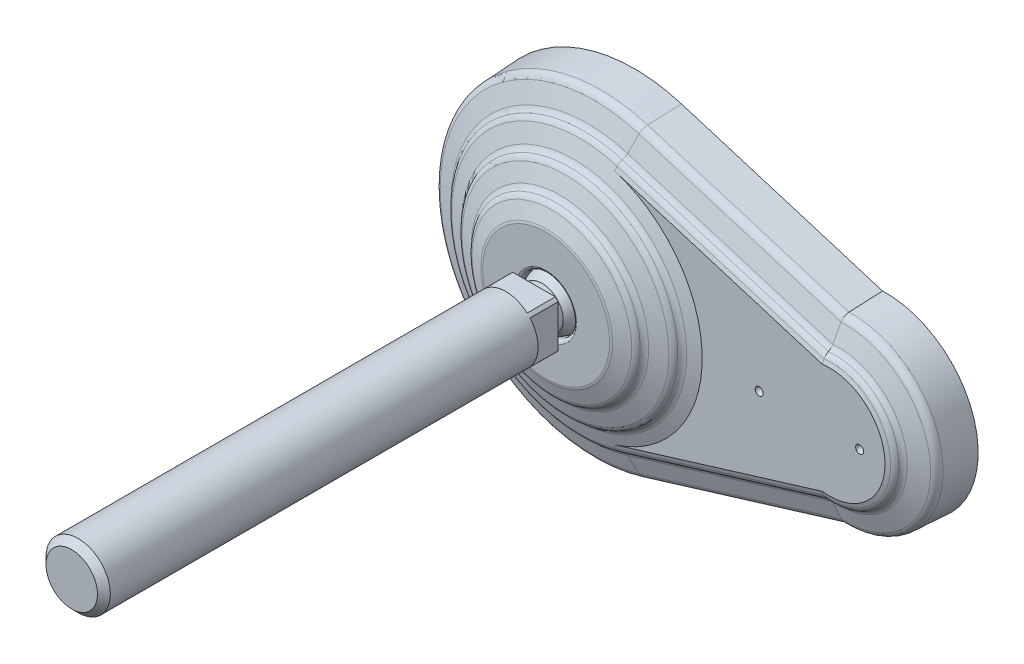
ISO-10303-21;
HEADER;
FILE_DESCRIPTION(('STEP AP214'),'2;1');
FILE_NAME('part.step','',(''),(''),'','','');
FILE_SCHEMA(('AUTOMOTIVE_DESIGN { 1 0 10303 214 1 1 1 1 }'));
ENDSEC;
DATA;
#1=APPLICATION_CONTEXT('core data for automotive mechanical design processes');
#2=APPLICATION_PROTOCOL_DEFINITION('international standard','automotive_design',2000,#1);
#3=PRODUCT_CONTEXT('',#1,'mechanical');
#4=PRODUCT('Part','Part','',(#3));
#5=PRODUCT_RELATED_PRODUCT_CATEGORY('part','',(#4));
#6=PRODUCT_DEFINITION_FORMATION('','',#4);
#7=PRODUCT_DEFINITION_CONTEXT('part definition',#1,'design');
#8=PRODUCT_DEFINITION('design','',#6,#7);
#9=PRODUCT_DEFINITION_SHAPE('','',#8);
#10=(LENGTH_UNIT() NAMED_UNIT(*) SI_UNIT(.MILLI.,.METRE.));
#11=(NAMED_UNIT(*) PLANE_ANGLE_UNIT() SI_UNIT($,.RADIAN.));
#12=(NAMED_UNIT(*) SI_UNIT($,.STERADIAN.) SOLID_ANGLE_UNIT());
#13=UNCERTAINTY_MEASURE_WITH_UNIT(LENGTH_MEASURE(1.E-05),#10,'distance_accuracy_value','');
#14=(GEOMETRIC_REPRESENTATION_CONTEXT(3) GLOBAL_UNCERTAINTY_ASSIGNED_CONTEXT((#13)) GLOBAL_UNIT_ASSIGNED_CONTEXT((#10,
#11,#12)) REPRESENTATION_CONTEXT('',''));
#15=CARTESIAN_POINT('',(0.,0.,0.));
#16=DIRECTION('',(0.,0.,1.));
#17=DIRECTION('',(1.,0.,0.));
#18=AXIS2_PLACEMENT_3D('',#15,#16,#17);
#19=CARTESIAN_POINT('',(0.,0.,34.));
#20=DIRECTION('',(0.,0.,1.));
#21=DIRECTION('',(-1.,0.,0.));
#22=AXIS2_PLACEMENT_3D('',#19,#20,#21);
#23=CYLINDRICAL_SURFACE('',#22,8.);
#24=CARTESIAN_POINT('',(0.,0.,140.4));
#25=DIRECTION('',(0.,0.,1.));
#26=DIRECTION('',(-1.,0.,0.));
#27=AXIS2_PLACEMENT_3D('',#24,#25,#26);
#28=CIRCLE('',#27,8.);
#29=CARTESIAN_POINT('',(-8.,0.,140.4));
#30=VERTEX_POINT('',#29);
#31=EDGE_CURVE('E9',#30,#30,#28,.F.);
#32=ORIENTED_EDGE('',*,*,#31,.T.);
#33=EDGE_LOOP('',(#32));
#34=FACE_BOUND('',#33,.T.);
#35=DIRECTION('',(0.,0.,1.));
#36=VECTOR('',#35,1.);
#37=CARTESIAN_POINT('',(-5.29150262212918,-6.,34.));
#38=LINE('',#37,#36);
#39=CARTESIAN_POINT('',(-5.29150262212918,-6.,34.));
#40=VERTEX_POINT('',#39);
#41=CARTESIAN_POINT('',(-5.29150262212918,-6.,27.));
#42=VERTEX_POINT('',#41);
#43=EDGE_CURVE('E415',#40,#42,#38,.F.);
#44=ORIENTED_EDGE('',*,*,#43,.F.);
#45=CARTESIAN_POINT('',(0.,0.,34.));
#46=DIRECTION('',(0.,0.,1.));
#47=DIRECTION('',(0.,-1.,0.));
#48=AXIS2_PLACEMENT_3D('',#45,#46,#47);
#49=CIRCLE('',#48,8.);
#50=CARTESIAN_POINT('',(5.29150262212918,-6.,34.));
#51=VERTEX_POINT('',#50);
#52=EDGE_CURVE('E500',#40,#51,#49,.T.);
#53=ORIENTED_EDGE('',*,*,#52,.T.);
#54=DIRECTION('',(0.,0.,1.));
#55=VECTOR('',#54,1.);
#56=CARTESIAN_POINT('',(5.29150262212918,-6.,34.));
#57=LINE('',#56,#55);
#58=CARTESIAN_POINT('',(5.29150262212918,-6.,27.));
#59=VERTEX_POINT('',#58);
#60=EDGE_CURVE('E420',#59,#51,#57,.T.);
#61=ORIENTED_EDGE('',*,*,#60,.F.);
#62=CARTESIAN_POINT('',(0.,0.,27.));
#63=DIRECTION('',(0.,0.,1.));
#64=DIRECTION('',(-1.,0.,0.));
#65=AXIS2_PLACEMENT_3D('',#62,#63,#64);
#66=CIRCLE('',#65,8.);
#67=CARTESIAN_POINT('',(6.,-5.29150262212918,27.));
#68=VERTEX_POINT('',#67);
#69=EDGE_CURVE('E533',#59,#68,#66,.T.);
#70=ORIENTED_EDGE('',*,*,#69,.T.);
#71=DIRECTION('',(0.,0.,1.));
#72=VECTOR('',#71,1.);
#73=CARTESIAN_POINT('',(6.,-5.29150262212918,34.));
#74=LINE('',#73,#72);
#75=CARTESIAN_POINT('',(6.,-5.29150262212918,34.));
#76=VERTEX_POINT('',#75);
#77=EDGE_CURVE('E423',#76,#68,#74,.F.);
#78=ORIENTED_EDGE('',*,*,#77,.F.);
#79=CARTESIAN_POINT('',(6.,5.29150262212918,34.));
#80=VERTEX_POINT('',#79);
#81=EDGE_CURVE('E417',#76,#80,#49,.T.);
#82=ORIENTED_EDGE('',*,*,#81,.T.);
#83=DIRECTION('',(0.,0.,1.));
#84=VECTOR('',#83,1.);
#85=CARTESIAN_POINT('',(6.,5.29150262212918,34.));
#86=LINE('',#85,#84);
#87=CARTESIAN_POINT('',(6.,5.29150262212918,27.));
#88=VERTEX_POINT('',#87);
#89=EDGE_CURVE('E433',#88,#80,#86,.T.);
#90=ORIENTED_EDGE('',*,*,#89,.F.);
#91=CARTESIAN_POINT('',(5.29150262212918,6.,27.));
#92=VERTEX_POINT('',#91);
#93=EDGE_CURVE('E531',#88,#92,#66,.T.);
#94=ORIENTED_EDGE('',*,*,#93,.T.);
#95=DIRECTION('',(0.,0.,1.));
#96=VECTOR('',#95,1.);
#97=CARTESIAN_POINT('',(5.29150262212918,6.,34.));
#98=LINE('',#97,#96);
#99=CARTESIAN_POINT('',(5.29150262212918,6.,34.));
#100=VERTEX_POINT('',#99);
#101=EDGE_CURVE('E436',#100,#92,#98,.F.);
#102=ORIENTED_EDGE('',*,*,#101,.F.);
#103=CARTESIAN_POINT('',(-5.29150262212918,6.,34.));
#104=VERTEX_POINT('',#103);
#105=EDGE_CURVE('E499',#100,#104,#49,.T.);
#106=ORIENTED_EDGE('',*,*,#105,.T.);
#107=DIRECTION('',(0.,0.,1.));
#108=VECTOR('',#107,1.);
#109=CARTESIAN_POINT('',(-5.29150262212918,6.,34.));
#110=LINE('',#109,#108);
#111=CARTESIAN_POINT('',(-5.29150262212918,6.,27.));
#112=VERTEX_POINT('',#111);
#113=EDGE_CURVE('E447',#112,#104,#110,.T.);
#114=ORIENTED_EDGE('',*,*,#113,.F.);
#115=CARTESIAN_POINT('',(-6.,5.29150262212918,27.));
#116=VERTEX_POINT('',#115);
#117=EDGE_CURVE('E460',#112,#116,#66,.T.);
#118=ORIENTED_EDGE('',*,*,#117,.T.);
#119=DIRECTION('',(0.,0.,1.));
#120=VECTOR('',#119,1.);
#121=CARTESIAN_POINT('',(-6.,5.29150262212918,34.));
#122=LINE('',#121,#120);
#123=CARTESIAN_POINT('',(-6.,5.29150262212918,34.));
#124=VERTEX_POINT('',#123);
#125=EDGE_CURVE('E450',#124,#116,#122,.F.);
#126=ORIENTED_EDGE('',*,*,#125,.F.);
#127=CARTESIAN_POINT('',(-6.,-5.29150262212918,34.));
#128=VERTEX_POINT('',#127);
#129=EDGE_CURVE('E493',#124,#128,#49,.T.);
#130=ORIENTED_EDGE('',*,*,#129,.T.);
#131=DIRECTION('',(0.,0.,1.));
#132=VECTOR('',#131,1.);
#133=CARTESIAN_POINT('',(-6.,-5.29150262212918,34.));
#134=LINE('',#133,#132);
#135=CARTESIAN_POINT('',(-6.,-5.29150262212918,27.));
#136=VERTEX_POINT('',#135);
#137=EDGE_CURVE('E458',#136,#128,#134,.T.);
#138=ORIENTED_EDGE('',*,*,#137,.F.);
#139=EDGE_CURVE('E404',#136,#42,#66,.T.);
#140=ORIENTED_EDGE('',*,*,#139,.T.);
#141=EDGE_LOOP('',(#44,#53,#61,#70,#78,#82,#90,#94,#102,#106,#114,#118,#126,#130,#138,#140));
#142=FACE_BOUND('',#141,.T.);
#143=ADVANCED_FACE('F15',(#34,#142),#23,.T.);
#144=CARTESIAN_POINT('',(64.1644462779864,-21.755748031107,10.3041173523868));
#145=DIRECTION('',(-0.291971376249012,0.9549953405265,-0.0523126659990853));
#146=DIRECTION('',(-0.956304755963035,-0.292371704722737,0.));
#147=AXIS2_PLACEMENT_3D('',#144,#145,#146);
#148=PLANE('',#147);
#149=CARTESIAN_POINT('',(61.6406997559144,-22.5273238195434,10.3043173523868));
#150=CARTESIAN_POINT('',(61.6501805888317,-22.600242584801,8.92023165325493));
#151=CARTESIAN_POINT('',(61.6596900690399,-22.6731526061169,7.53614569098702));
#152=CARTESIAN_POINT('',(61.6787663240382,-22.8189551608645,4.76797324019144));
#153=CARTESIAN_POINT('',(61.6883330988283,-22.8918476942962,3.38388675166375));
#154=CARTESIAN_POINT('',(61.6979285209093,-22.9647314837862,1.9998));
#155=B_SPLINE_CURVE_WITH_KNOTS('',3,(#149,#150,#151,#152,#153,#154),.UNSPECIFIED.,.F.,.F.,(4,2,
4),(0.,4.15811282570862,8.31622565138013),.UNSPECIFIED.);
#156=CARTESIAN_POINT('',(61.6407011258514,-22.5273343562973,10.3041173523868));
#157=VERTEX_POINT('',#156);
#158=CARTESIAN_POINT('',(61.697927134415,-22.9647209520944,2.));
#159=VERTEX_POINT('',#158);
#160=EDGE_CURVE('E1095',#157,#159,#155,.T.);
#161=ORIENTED_EDGE('',*,*,#160,.F.);
#162=DIRECTION('',(-0.956304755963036,-0.292371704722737,0.));
#163=VECTOR('',#162,1.);
#164=CARTESIAN_POINT('',(64.1644462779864,-21.755748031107,10.3041173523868));
#165=LINE('',#164,#163);
#166=CARTESIAN_POINT('',(11.5676847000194,-37.8361917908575,10.3041173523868));
#167=VERTEX_POINT('',#166);
#168=EDGE_CURVE('E1156',#157,#167,#165,.T.);
#169=ORIENTED_EDGE('',*,*,#168,.T.);
#170=DIRECTION('',(-0.0152947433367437,0.050026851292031,0.998630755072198));
#171=VECTOR('',#170,1.);
#172=CARTESIAN_POINT('',(11.6948681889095,-38.2521902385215,2.));
#173=LINE('',#172,#171);
#174=CARTESIAN_POINT('',(11.6948681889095,-38.2521902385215,2.));
#175=VERTEX_POINT('',#174);
#176=EDGE_CURVE('E1166',#175,#167,#173,.T.);
#177=ORIENTED_EDGE('',*,*,#176,.F.);
#178=DIRECTION('',(-0.956304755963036,-0.292371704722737,0.));
#179=VECTOR('',#178,1.);
#180=CARTESIAN_POINT('',(64.2916297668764,-22.1717464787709,2.));
#181=LINE('',#180,#179);
#182=EDGE_CURVE('E186',#159,#175,#181,.T.);
#183=ORIENTED_EDGE('',*,*,#182,.F.);
#184=EDGE_LOOP('',(#161,#169,#177,#183));
#185=FACE_BOUND('',#184,.T.);
#186=ADVANCED_FACE('F353',(#185),#148,.F.);
#187=CARTESIAN_POINT('',(61.6120778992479,-13.407327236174,16.));
#188=DIRECTION('',(-0.102070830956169,0.333858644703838,-0.937080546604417));
#189=DIRECTION('',(0.,0.942000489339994,0.335611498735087));
#190=AXIS2_PLACEMENT_3D('',#187,#188,#189);
#191=PLANE('',#190);
#192=CARTESIAN_POINT('',(60.6773763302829,-13.6925328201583,16.0002));
#193=CARTESIAN_POINT('',(60.6914441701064,-13.863175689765,15.9378718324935));
#194=CARTESIAN_POINT('',(60.7058313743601,-14.0337829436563,15.8755215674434));
#195=CARTESIAN_POINT('',(60.735244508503,-14.3749261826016,15.7507768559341));
#196=CARTESIAN_POINT('',(60.750270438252,-14.5454621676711,15.6883824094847));
#197=CARTESIAN_POINT('',(60.7656157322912,-14.7159625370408,15.6259658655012));
#198=B_SPLINE_CURVE_WITH_KNOTS('',3,(#192,#193,#194,#195,#196,#197),.UNSPECIFIED.,.F.,.F.,(4,2,
4),(0.,0.546637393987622,1.09327466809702),.UNSPECIFIED.);
#199=CARTESIAN_POINT('',(60.677421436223,-13.6930803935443,16.));
#200=VERTEX_POINT('',#199);
#201=CARTESIAN_POINT('',(60.765566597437,-14.7154161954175,15.6261658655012));
#202=VERTEX_POINT('',#201);
#203=EDGE_CURVE('E166',#200,#202,#198,.T.);
#204=ORIENTED_EDGE('',*,*,#203,.F.);
#205=DIRECTION('',(-0.956304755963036,-0.292371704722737,0.));
#206=VECTOR('',#205,1.);
#207=CARTESIAN_POINT('',(61.6120778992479,-13.407327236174,16.));
#208=LINE('',#207,#206);
#209=CARTESIAN_POINT('',(9.01531632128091,-29.4877709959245,16.));
#210=VERTEX_POINT('',#209);
#211=EDGE_CURVE('E170',#200,#210,#208,.T.);
#212=ORIENTED_EDGE('',*,*,#211,.T.);
#213=DIRECTION('',(-0.273975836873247,0.896134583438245,0.349113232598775));
#214=VECTOR('',#213,1.);
#215=CARTESIAN_POINT('',(9.30869253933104,-30.4473613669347,15.6261658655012));
#216=LINE('',#215,#214);
#217=CARTESIAN_POINT('',(9.30869253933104,-30.4473613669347,15.6261658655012));
#218=VERTEX_POINT('',#217);
#219=EDGE_CURVE('E1181',#218,#210,#216,.T.);
#220=ORIENTED_EDGE('',*,*,#219,.F.);
#221=DIRECTION('',(-0.956304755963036,-0.292371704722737,0.));
#222=VECTOR('',#221,1.);
#223=CARTESIAN_POINT('',(61.905454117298,-14.3669176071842,15.6261658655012));
#224=LINE('',#223,#222);
#225=EDGE_CURVE('E172',#202,#218,#224,.T.);
#226=ORIENTED_EDGE('',*,*,#225,.F.);
#227=EDGE_LOOP('',(#204,#212,#220,#226));
#228=FACE_BOUND('',#227,.T.);
#229=ADVANCED_FACE('F168',(#228),#191,.F.);
#230=CARTESIAN_POINT('',(62.7507979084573,-17.131912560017,15.5370123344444));
#231=DIRECTION('',(-0.956304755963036,-0.292371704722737,0.));
#232=DIRECTION('',(0.292371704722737,-0.956304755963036,0.));
#233=AXIS2_PLACEMENT_3D('',#230,#231,#232);
#234=CYLINDRICAL_SURFACE('',#233,2.00700000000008);
#235=DIRECTION('',(-0.956304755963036,-0.292371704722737,0.));
#236=VECTOR('',#235,1.);
#237=CARTESIAN_POINT('',(62.545973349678,-16.4619616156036,13.656251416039));
#238=LINE('',#237,#236);
#239=CARTESIAN_POINT('',(60.9818619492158,-16.9401584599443,13.656251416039));
#240=VERTEX_POINT('',#239);
#241=CARTESIAN_POINT('',(9.949211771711,-32.5424053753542,13.656251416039));
#242=VERTEX_POINT('',#241);
#243=EDGE_CURVE('E1160',#240,#242,#238,.T.);
#244=ORIENTED_EDGE('',*,*,#243,.F.);
#245=CARTESIAN_POINT('',(60.9819185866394,-16.9407028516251,13.656051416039));
#246=CARTESIAN_POINT('',(60.9763282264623,-16.8869710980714,13.675784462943));
#247=CARTESIAN_POINT('',(60.9708503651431,-16.8340792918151,13.697757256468));
#248=CARTESIAN_POINT('',(60.9601474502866,-16.7302929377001,13.7460604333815));
#249=CARTESIAN_POINT('',(60.9549224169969,-16.6793985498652,13.77239116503));
#250=CARTESIAN_POINT('',(60.9396574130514,-16.5300811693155,13.8578002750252));
#251=CARTESIAN_POINT('',(60.9300410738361,-16.4351542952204,13.9232476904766));
#252=CARTESIAN_POINT('',(60.9121877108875,-16.2575900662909,14.0693279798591));
#253=CARTESIAN_POINT('',(60.903952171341,-16.1749659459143,14.1499769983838));
#254=CARTESIAN_POINT('',(60.8890756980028,-16.0247595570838,14.3241094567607));
#255=CARTESIAN_POINT('',(60.8824301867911,-15.9571341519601,14.4175548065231));
#256=CARTESIAN_POINT('',(60.8754548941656,-15.8858007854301,14.5364334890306));
#257=CARTESIAN_POINT('',(60.8742920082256,-15.8738939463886,14.5571086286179));
#258=CARTESIAN_POINT('',(60.8720425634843,-15.8508368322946,14.59885583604));
#259=CARTESIAN_POINT('',(60.8709559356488,-15.839685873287,14.6199275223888));
#260=CARTESIAN_POINT('',(60.869906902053,-15.8289098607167,14.6412000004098));
#261=B_SPLINE_CURVE_WITH_KNOTS('',3,(#245,#246,#247,#248,#249,#250,#251,#252,#253,#254,#255,
#256,#257,#258,#259,#260),.UNSPECIFIED.,.F.,.F.,(4,2,2,2,2,2,2,4),(0.,0.172434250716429,
0.344882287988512,0.690191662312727,1.0358698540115,1.38054058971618,1.4521941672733,
1.52378201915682),.UNSPECIFIED.);
#262=CARTESIAN_POINT('',(60.8699167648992,-15.8290111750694,14.6410000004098));
#263=VERTEX_POINT('',#262);
#264=EDGE_CURVE('E278',#240,#263,#261,.T.);
#265=ORIENTED_EDGE('',*,*,#264,.T.);
#266=DIRECTION('',(-0.956304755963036,-0.292371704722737,0.));
#267=VECTOR('',#266,1.);
#268=CARTESIAN_POINT('',(62.2257313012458,-15.4144970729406,14.6410000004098));
#269=LINE('',#268,#267);
#270=CARTESIAN_POINT('',(9.62896972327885,-31.4949408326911,14.6410000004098));
#271=VERTEX_POINT('',#270);
#272=EDGE_CURVE('E1162',#263,#271,#269,.T.);
#273=ORIENTED_EDGE('',*,*,#272,.T.);
#274=CARTESIAN_POINT('',(10.1540363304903,-33.2123563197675,15.5370123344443));
#275=DIRECTION('',(0.956304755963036,0.292371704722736,0.));
#276=DIRECTION('',(-0.292371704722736,0.956304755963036,0.));
#277=AXIS2_PLACEMENT_3D('',#274,#275,#276);
#278=CIRCLE('',#277,2.00700000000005);
#279=EDGE_CURVE('E1175',#242,#271,#278,.T.);
#280=ORIENTED_EDGE('',*,*,#279,.F.);
#281=EDGE_LOOP('',(#244,#265,#273,#280));
#282=FACE_BOUND('',#281,.T.);
#283=ADVANCED_FACE('F330',(#282),#234,.F.);
#284=CARTESIAN_POINT('',(62.545973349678,-16.4619616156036,13.656251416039));
#285=DIRECTION('',(-0.102055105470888,0.333807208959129,-0.937100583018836));
#286=DIRECTION('',(0.,0.942019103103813,0.335559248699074));
#287=AXIS2_PLACEMENT_3D('',#284,#285,#286);
#288=PLANE('',#287);
#289=CARTESIAN_POINT('',(60.9818053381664,-16.9396143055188,13.656451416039));
#290=CARTESIAN_POINT('',(61.0189355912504,-17.2964789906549,13.5252879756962));
#291=CARTESIAN_POINT('',(61.0571375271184,-17.653206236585,13.3940567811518));
#292=CARTESIAN_POINT('',(61.1355151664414,-18.3663907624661,13.1314756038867));
#293=CARTESIAN_POINT('',(61.1756908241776,-18.7228480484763,13.0001256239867));
#294=CARTESIAN_POINT('',(61.2578477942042,-19.435511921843,12.7373183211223));
#295=CARTESIAN_POINT('',(61.2998290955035,-19.7917185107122,12.6058609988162));
#296=CARTESIAN_POINT('',(61.3854616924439,-20.5039033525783,12.3428458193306));
#297=CARTESIAN_POINT('',(61.4291130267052,-20.8598816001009,12.2112879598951));
#298=CARTESIAN_POINT('',(61.4735304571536,-21.2157475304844,12.0796866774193));
#299=B_SPLINE_CURVE_WITH_KNOTS('',3,(#289,#290,#291,#292,#293,#294,#295,#296,#297,#298),
.UNSPECIFIED.,.F.,.F.,(4,2,2,2,4),(0.,1.14603990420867,2.29205327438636,3.43805966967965,
4.58409258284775),.UNSPECIFIED.);
#300=CARTESIAN_POINT('',(61.4734629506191,-21.2152067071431,12.0798866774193));
#301=VERTEX_POINT('',#300);
#302=EDGE_CURVE('E311',#240,#301,#299,.T.);
#303=ORIENTED_EDGE('',*,*,#302,.F.);
#304=ORIENTED_EDGE('',*,*,#243,.T.);
#305=DIRECTION('',(-0.273981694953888,0.896153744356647,0.349059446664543));
#306=VECTOR('',#305,1.);
#307=CARTESIAN_POINT('',(11.1865227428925,-36.5894672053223,12.0798866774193));
#308=LINE('',#307,#306);
#309=CARTESIAN_POINT('',(11.1865227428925,-36.5894672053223,12.0798866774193));
#310=VERTEX_POINT('',#309);
#311=EDGE_CURVE('E1172',#310,#242,#308,.T.);
#312=ORIENTED_EDGE('',*,*,#311,.F.);
#313=DIRECTION('',(-0.956304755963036,-0.292371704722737,0.));
#314=VECTOR('',#313,1.);
#315=CARTESIAN_POINT('',(63.7832843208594,-20.5090234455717,12.0798866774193));
#316=LINE('',#315,#314);
#317=EDGE_CURVE('E1158',#301,#310,#316,.T.);
#318=ORIENTED_EDGE('',*,*,#317,.F.);
#319=EDGE_LOOP('',(#303,#304,#312,#318));
#320=FACE_BOUND('',#319,.T.);
#321=ADVANCED_FACE('F325',(#320),#288,.F.);
#322=CARTESIAN_POINT('',(64.2916297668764,22.1717464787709,2.));
#323=DIRECTION('',(-0.291971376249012,-0.9549953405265,-0.0523126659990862));
#324=DIRECTION('',(0.956304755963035,-0.292371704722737,0.));
#325=AXIS2_PLACEMENT_3D('',#322,#323,#324);
#326=PLANE('',#325);
#327=CARTESIAN_POINT('',(61.6979285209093,22.9647314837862,1.9998));
#328=CARTESIAN_POINT('',(61.6883330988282,22.8918476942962,3.38388675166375));
#329=CARTESIAN_POINT('',(61.6787663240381,22.8189551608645,4.76797324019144));
#330=CARTESIAN_POINT('',(61.6596900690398,22.6731526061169,7.53614569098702));
#331=CARTESIAN_POINT('',(61.6501805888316,22.600242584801,8.92023165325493));
#332=CARTESIAN_POINT('',(61.6406997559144,22.5273238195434,10.3043173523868));
#333=B_SPLINE_CURVE_WITH_KNOTS('',3,(#327,#328,#329,#330,#331,#332),.UNSPECIFIED.,.F.,.F.,(4,2,
4),(0.,4.15811282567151,8.31622565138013),.UNSPECIFIED.);
#334=CARTESIAN_POINT('',(61.6979271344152,22.9647209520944,2.));
#335=VERTEX_POINT('',#334);
#336=CARTESIAN_POINT('',(61.6407011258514,22.5273343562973,10.3041173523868));
#337=VERTEX_POINT('',#336);
#338=EDGE_CURVE('E1088',#335,#337,#333,.T.);
#339=ORIENTED_EDGE('',*,*,#338,.F.);
#340=DIRECTION('',(-0.956304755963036,0.292371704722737,0.));
#341=VECTOR('',#340,1.);
#342=CARTESIAN_POINT('',(64.2916297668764,22.1717464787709,2.));
#343=LINE('',#342,#341);
#344=CARTESIAN_POINT('',(11.6948681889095,38.2521902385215,2.));
#345=VERTEX_POINT('',#344);
#346=EDGE_CURVE('E1154',#335,#345,#343,.T.);
#347=ORIENTED_EDGE('',*,*,#346,.T.);
#348=DIRECTION('',(-0.0152947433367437,-0.050026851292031,0.998630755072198));
#349=VECTOR('',#348,1.);
#350=CARTESIAN_POINT('',(11.6948681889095,38.2521902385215,2.));
#351=LINE('',#350,#349);
#352=CARTESIAN_POINT('',(11.5676847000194,37.8361917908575,10.3041173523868));
#353=VERTEX_POINT('',#352);
#354=EDGE_CURVE('E1183',#345,#353,#351,.T.);
#355=ORIENTED_EDGE('',*,*,#354,.T.);
#356=DIRECTION('',(-0.956304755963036,0.292371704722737,0.));
#357=VECTOR('',#356,1.);
#358=CARTESIAN_POINT('',(64.1644462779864,21.755748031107,10.3041173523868));
#359=LINE('',#358,#357);
#360=EDGE_CURVE('E1152',#337,#353,#359,.T.);
#361=ORIENTED_EDGE('',*,*,#360,.F.);
#362=EDGE_LOOP('',(#339,#347,#355,#361));
#363=FACE_BOUND('',#362,.T.);
#364=ADVANCED_FACE('F329',(#363),#326,.F.);
#365=CARTESIAN_POINT('',(63.7832843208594,20.5090234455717,12.0798866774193));
#366=DIRECTION('',(-0.102055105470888,-0.333807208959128,-0.937100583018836));
#367=DIRECTION('',(0.,0.942019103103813,-0.335559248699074));
#368=AXIS2_PLACEMENT_3D('',#365,#366,#367);
#369=PLANE('',#368);
#370=CARTESIAN_POINT('',(61.4735304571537,21.2157475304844,12.0796866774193));
#371=CARTESIAN_POINT('',(61.4291130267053,20.8598816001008,12.2112879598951));
#372=CARTESIAN_POINT('',(61.3854616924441,20.5039033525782,12.3428458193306));
#373=CARTESIAN_POINT('',(61.2998290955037,19.7917185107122,12.6058609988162));
#374=CARTESIAN_POINT('',(61.2578477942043,19.435511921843,12.7373183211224));
#375=CARTESIAN_POINT('',(61.1756908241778,18.7228480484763,13.0001256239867));
#376=CARTESIAN_POINT('',(61.1355151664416,18.3663907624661,13.1314756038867));
#377=CARTESIAN_POINT('',(61.0571375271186,17.653206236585,13.3940567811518));
#378=CARTESIAN_POINT('',(61.0189355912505,17.2964789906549,13.5252879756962));
#379=CARTESIAN_POINT('',(60.9818053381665,16.9396143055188,13.656451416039));
#380=B_SPLINE_CURVE_WITH_KNOTS('',3,(#370,#371,#372,#373,#374,#375,#376,#377,#378,#379),
.UNSPECIFIED.,.F.,.F.,(4,2,2,2,4),(0.,1.14603291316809,2.29203930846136,3.43805267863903,
4.58409258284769),.UNSPECIFIED.);
#381=CARTESIAN_POINT('',(61.4734629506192,21.2152067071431,12.0798866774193));
#382=VERTEX_POINT('',#381);
#383=CARTESIAN_POINT('',(60.9818619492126,16.9401584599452,13.656251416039));
#384=VERTEX_POINT('',#383);
#385=EDGE_CURVE('E305',#382,#384,#380,.T.);
#386=ORIENTED_EDGE('',*,*,#385,.F.);
#387=DIRECTION('',(-0.956304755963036,0.292371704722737,0.));
#388=VECTOR('',#387,1.);
#389=CARTESIAN_POINT('',(63.7832843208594,20.5090234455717,12.0798866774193));
#390=LINE('',#389,#388);
#391=CARTESIAN_POINT('',(11.1865227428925,36.5894672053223,12.0798866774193));
#392=VERTEX_POINT('',#391);
#393=EDGE_CURVE('E1150',#382,#392,#390,.T.);
#394=ORIENTED_EDGE('',*,*,#393,.T.);
#395=DIRECTION('',(-0.273981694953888,-0.896153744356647,0.349059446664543));
#396=VECTOR('',#395,1.);
#397=CARTESIAN_POINT('',(11.1865227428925,36.5894672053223,12.0798866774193));
#398=LINE('',#397,#396);
#399=CARTESIAN_POINT('',(9.949211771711,32.5424053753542,13.656251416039));
#400=VERTEX_POINT('',#399);
#401=EDGE_CURVE('E1189',#392,#400,#398,.T.);
#402=ORIENTED_EDGE('',*,*,#401,.T.);
#403=DIRECTION('',(-0.956304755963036,0.292371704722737,0.));
#404=VECTOR('',#403,1.);
#405=CARTESIAN_POINT('',(62.545973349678,16.4619616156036,13.656251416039));
#406=LINE('',#405,#404);
#407=EDGE_CURVE('E1148',#384,#400,#406,.T.);
#408=ORIENTED_EDGE('',*,*,#407,.F.);
#409=EDGE_LOOP('',(#386,#394,#402,#408));
#410=FACE_BOUND('',#409,.T.);
#411=ADVANCED_FACE('F266',(#410),#369,.F.);
#412=CARTESIAN_POINT('',(62.7507979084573,17.1319125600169,15.5370123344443));
#413=DIRECTION('',(-0.956304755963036,0.292371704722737,0.));
#414=DIRECTION('',(-0.292371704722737,-0.956304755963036,0.));
#415=AXIS2_PLACEMENT_3D('',#412,#413,#414);
#416=CYLINDRICAL_SURFACE('',#415,2.007);
#417=DIRECTION('',(-0.956304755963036,0.292371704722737,0.));
#418=VECTOR('',#417,1.);
#419=CARTESIAN_POINT('',(62.2257313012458,15.4144970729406,14.6410000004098));
#420=LINE('',#419,#418);
#421=CARTESIAN_POINT('',(60.8699167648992,15.8290111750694,14.6410000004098));
#422=VERTEX_POINT('',#421);
#423=CARTESIAN_POINT('',(9.62896972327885,31.4949408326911,14.6410000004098));
#424=VERTEX_POINT('',#423);
#425=EDGE_CURVE('E1146',#422,#424,#420,.T.);
#426=ORIENTED_EDGE('',*,*,#425,.F.);
#427=CARTESIAN_POINT('',(60.869906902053,15.8289098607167,14.6412000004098));
#428=CARTESIAN_POINT('',(60.8724049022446,15.8545692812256,14.5905409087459));
#429=CARTESIAN_POINT('',(60.8751177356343,15.882373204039,14.5410120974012));
#430=CARTESIAN_POINT('',(60.8809599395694,15.9420653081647,14.4445128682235));
#431=CARTESIAN_POINT('',(60.8840892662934,15.9739530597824,14.3975421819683));
#432=CARTESIAN_POINT('',(60.8940798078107,16.0754098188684,14.2609440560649));
#433=CARTESIAN_POINT('',(60.9015461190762,16.1507985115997,14.1755790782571));
#434=CARTESIAN_POINT('',(60.9179069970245,16.3146445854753,14.0187596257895));
#435=CARTESIAN_POINT('',(60.9268017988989,16.4031041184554,13.9473074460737));
#436=CARTESIAN_POINT('',(60.9458071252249,16.5904449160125,13.8202080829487));
#437=CARTESIAN_POINT('',(60.9559150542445,16.6893038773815,13.7645279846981));
#438=CARTESIAN_POINT('',(60.9690169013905,16.8162843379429,13.7062217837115));
#439=CARTESIAN_POINT('',(60.9715630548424,16.8409104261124,13.6954970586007));
#440=CARTESIAN_POINT('',(60.9767040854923,16.8905299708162,13.6750365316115));
#441=CARTESIAN_POINT('',(60.9792989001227,16.9155229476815,13.6652995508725));
#442=CARTESIAN_POINT('',(60.9819185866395,16.940702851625,13.656051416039));
#443=B_SPLINE_CURVE_WITH_KNOTS('',3,(#427,#428,#429,#430,#431,#432,#433,#434,#435,#436,#437,
#438,#439,#440,#441,#442),.UNSPECIFIED.,.F.,.F.,(4,2,2,2,2,2,2,4),(0.,0.170415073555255,
0.340812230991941,0.68143537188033,1.0221146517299,1.36207763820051,1.44300799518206,
1.52384059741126),.UNSPECIFIED.);
#444=EDGE_CURVE('E271',#422,#384,#443,.T.);
#445=ORIENTED_EDGE('',*,*,#444,.T.);
#446=ORIENTED_EDGE('',*,*,#407,.T.);
#447=CARTESIAN_POINT('',(10.1540363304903,33.2123563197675,15.5370123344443));
#448=DIRECTION('',(-0.956304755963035,0.292371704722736,0.));
#449=DIRECTION('',(-0.292371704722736,-0.956304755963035,0.));
#450=AXIS2_PLACEMENT_3D('',#447,#448,#449);
#451=CIRCLE('',#450,2.00700000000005);
#452=EDGE_CURVE('E1192',#400,#424,#451,.T.);
#453=ORIENTED_EDGE('',*,*,#452,.T.);
#454=EDGE_LOOP('',(#426,#445,#446,#453));
#455=FACE_BOUND('',#454,.T.);
#456=ADVANCED_FACE('F253',(#455),#416,.F.);
#457=CARTESIAN_POINT('',(61.905454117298,14.3669176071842,15.6261658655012));
#458=DIRECTION('',(-0.102070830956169,-0.333858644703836,-0.937080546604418));
#459=DIRECTION('',(0.,0.942000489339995,-0.335611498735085));
#460=AXIS2_PLACEMENT_3D('',#457,#458,#459);
#461=PLANE('',#460);
#462=CARTESIAN_POINT('',(60.7656157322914,14.7159625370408,15.6259658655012));
#463=CARTESIAN_POINT('',(60.750270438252,14.5454621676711,15.6883824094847));
#464=CARTESIAN_POINT('',(60.7352445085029,14.3749261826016,15.7507768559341));
#465=CARTESIAN_POINT('',(60.70583137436,14.0337829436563,15.8755215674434));
#466=CARTESIAN_POINT('',(60.6914441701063,13.863175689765,15.9378718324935));
#467=CARTESIAN_POINT('',(60.6773763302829,13.6925328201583,16.0002));
#468=B_SPLINE_CURVE_WITH_KNOTS('',3,(#462,#463,#464,#465,#466,#467),.UNSPECIFIED.,.F.,.F.,(4,2,
4),(0.,0.546637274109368,1.09327466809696),.UNSPECIFIED.);
#469=CARTESIAN_POINT('',(60.7655665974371,14.7154161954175,15.6261658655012));
#470=VERTEX_POINT('',#469);
#471=CARTESIAN_POINT('',(60.6774214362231,13.6930803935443,16.));
#472=VERTEX_POINT('',#471);
#473=EDGE_CURVE('E191',#470,#472,#468,.T.);
#474=ORIENTED_EDGE('',*,*,#473,.F.);
#475=DIRECTION('',(-0.956304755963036,0.292371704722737,0.));
#476=VECTOR('',#475,1.);
#477=CARTESIAN_POINT('',(61.905454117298,14.3669176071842,15.6261658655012));
#478=LINE('',#477,#476);
#479=CARTESIAN_POINT('',(9.30869253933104,30.4473613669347,15.6261658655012));
#480=VERTEX_POINT('',#479);
#481=EDGE_CURVE('E1144',#470,#480,#478,.T.);
#482=ORIENTED_EDGE('',*,*,#481,.T.);
#483=DIRECTION('',(-0.273975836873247,-0.896134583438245,0.349113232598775));
#484=VECTOR('',#483,1.);
#485=CARTESIAN_POINT('',(9.30869253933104,30.4473613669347,15.6261658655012));
#486=LINE('',#485,#484);
#487=CARTESIAN_POINT('',(9.01531632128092,29.4877709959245,16.));
#488=VERTEX_POINT('',#487);
#489=EDGE_CURVE('E1198',#480,#488,#486,.T.);
#490=ORIENTED_EDGE('',*,*,#489,.T.);
#491=DIRECTION('',(-0.956304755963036,0.292371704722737,0.));
#492=VECTOR('',#491,1.);
#493=CARTESIAN_POINT('',(61.6120778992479,13.4073272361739,16.));
#494=LINE('',#493,#492);
#495=EDGE_CURVE('E1142',#472,#488,#494,.T.);
#496=ORIENTED_EDGE('',*,*,#495,.F.);
#497=EDGE_LOOP('',(#474,#482,#490,#496));
#498=FACE_BOUND('',#497,.T.);
#499=ADVANCED_FACE('F248',(#498),#461,.F.);
#500=CARTESIAN_POINT('',(0.,0.,2.));
#501=DIRECTION('',(0.,0.,1.));
#502=DIRECTION('',(-1.,0.,0.));
#503=AXIS2_PLACEMENT_3D('',#500,#501,#502);
#504=PLANE('',#503);
#505=ORIENTED_EDGE('',*,*,#346,.F.);
#506=CARTESIAN_POINT('',(62.5,0.,2.));
#507=DIRECTION('',(0.,0.,1.));
#508=DIRECTION('',(0.,-1.,0.));
#509=AXIS2_PLACEMENT_3D('',#506,#507,#508);
#510=CIRCLE('',#509,22.9787234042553);
#511=EDGE_CURVE('E177',#159,#335,#510,.T.);
#512=ORIENTED_EDGE('',*,*,#511,.F.);
#513=ORIENTED_EDGE('',*,*,#182,.T.);
#514=CARTESIAN_POINT('',(0.,0.,2.));
#515=DIRECTION('',(0.,0.,1.));
#516=DIRECTION('',(-1.,0.,0.));
#517=AXIS2_PLACEMENT_3D('',#514,#515,#516);
#518=CIRCLE('',#517,40.);
#519=EDGE_CURVE('E244',#345,#175,#518,.T.);
#520=ORIENTED_EDGE('',*,*,#519,.F.);
#521=EDGE_LOOP('',(#505,#512,#513,#520));
#522=FACE_BOUND('',#521,.T.);
#523=CARTESIAN_POINT('',(65.,0.,2.));
#524=DIRECTION('',(0.,0.,1.));
#525=DIRECTION('',(1.,0.,0.));
#526=AXIS2_PLACEMENT_3D('',#523,#524,#525);
#527=CIRCLE('',#526,16.);
#528=CARTESIAN_POINT('',(69.9230769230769,-15.2237746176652,2.));
#529=VERTEX_POINT('',#528);
#530=CARTESIAN_POINT('',(69.9230769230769,15.2237746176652,2.));
#531=VERTEX_POINT('',#530);
#532=EDGE_CURVE('E568',#529,#531,#527,.T.);
#533=ORIENTED_EDGE('',*,*,#532,.T.);
#534=DIRECTION('',(-0.951485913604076,0.307692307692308,0.));
#535=VECTOR('',#534,1.);
#536=CARTESIAN_POINT('',(69.9230769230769,15.2237746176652,2.));
#537=LINE('',#536,#535);
#538=CARTESIAN_POINT('',(11.0769230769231,34.2534928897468,2.));
#539=VERTEX_POINT('',#538);
#540=EDGE_CURVE('E32',#531,#539,#537,.T.);
#541=ORIENTED_EDGE('',*,*,#540,.T.);
#542=CARTESIAN_POINT('',(0.,0.,2.));
#543=DIRECTION('',(0.,0.,1.));
#544=DIRECTION('',(1.,0.,0.));
#545=AXIS2_PLACEMENT_3D('',#542,#543,#544);
#546=CIRCLE('',#545,36.);
#547=CARTESIAN_POINT('',(11.0769230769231,-34.2534928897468,2.));
#548=VERTEX_POINT('',#547);
#549=EDGE_CURVE('E575',#539,#548,#546,.T.);
#550=ORIENTED_EDGE('',*,*,#549,.T.);
#551=DIRECTION('',(0.951485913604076,0.307692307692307,0.));
#552=VECTOR('',#551,1.);
#553=CARTESIAN_POINT('',(11.0769230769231,-34.2534928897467,2.));
#554=LINE('',#553,#552);
#555=EDGE_CURVE('E570',#548,#529,#554,.T.);
#556=ORIENTED_EDGE('',*,*,#555,.T.);
#557=EDGE_LOOP('',(#533,#541,#550,#556));
#558=FACE_BOUND('',#557,.T.);
#559=ADVANCED_FACE('F252',(#522,#558),#504,.F.);
#560=CARTESIAN_POINT('',(0.,0.,2.));
#561=DIRECTION('',(0.,0.,-1.));
#562=DIRECTION('',(1.,0.,0.));
#563=AXIS2_PLACEMENT_3D('',#560,#561,#562);
#564=CONICAL_SURFACE('',#563,40.,0.0523365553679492);
#565=CARTESIAN_POINT('',(0.,0.,10.3041173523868));
#566=DIRECTION('',(0.,0.,1.));
#567=DIRECTION('',(-1.,0.,0.));
#568=AXIS2_PLACEMENT_3D('',#565,#566,#567);
#569=CIRCLE('',#568,39.5649938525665);
#570=EDGE_CURVE('E1212',#353,#167,#569,.T.);
#571=ORIENTED_EDGE('',*,*,#570,.F.);
#572=ORIENTED_EDGE('',*,*,#354,.F.);
#573=ORIENTED_EDGE('',*,*,#519,.T.);
#574=ORIENTED_EDGE('',*,*,#176,.T.);
#575=EDGE_LOOP('',(#571,#572,#573,#574));
#576=FACE_BOUND('',#575,.T.);
#577=ADVANCED_FACE('F1000',(#576),#564,.T.);
#578=CARTESIAN_POINT('',(0.,0.,10.1991258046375));
#579=DIRECTION('',(0.,0.,1.));
#580=DIRECTION('',(-1.,0.,0.));
#581=AXIS2_PLACEMENT_3D('',#578,#579,#580);
#582=TOROIDAL_SURFACE('',#581,37.5607419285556,2.007);
#583=CARTESIAN_POINT('',(0.,0.,12.0798866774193));
#584=DIRECTION('',(0.,0.,1.));
#585=DIRECTION('',(-1.,0.,0.));
#586=AXIS2_PLACEMENT_3D('',#583,#584,#585);
#587=CIRCLE('',#586,38.2613042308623);
#588=EDGE_CURVE('E1210',#392,#310,#587,.T.);
#589=ORIENTED_EDGE('',*,*,#588,.F.);
#590=CARTESIAN_POINT('',(10.9816981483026,35.9195161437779,10.1991258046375));
#591=DIRECTION('',(-0.956304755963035,0.292371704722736,0.));
#592=DIRECTION('',(-0.292371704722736,-0.956304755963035,0.));
#593=AXIS2_PLACEMENT_3D('',#590,#591,#592);
#594=CIRCLE('',#593,2.007);
#595=EDGE_CURVE('E1186',#392,#353,#594,.T.);
#596=ORIENTED_EDGE('',*,*,#595,.T.);
#597=ORIENTED_EDGE('',*,*,#570,.T.);
#598=CARTESIAN_POINT('',(10.9816981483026,-35.9195161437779,10.1991258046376));
#599=DIRECTION('',(0.956304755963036,0.292371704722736,0.));
#600=DIRECTION('',(-0.292371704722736,0.956304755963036,0.));
#601=AXIS2_PLACEMENT_3D('',#598,#599,#600);
#602=CIRCLE('',#601,2.007);
#603=EDGE_CURVE('E1169',#310,#167,#602,.T.);
#604=ORIENTED_EDGE('',*,*,#603,.F.);
#605=EDGE_LOOP('',(#589,#596,#597,#604));
#606=FACE_BOUND('',#605,.T.);
#607=ADVANCED_FACE('F991',(#606),#582,.T.);
#608=CARTESIAN_POINT('',(0.,0.,12.0798866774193));
#609=DIRECTION('',(0.,0.,-1.));
#610=DIRECTION('',(1.,0.,0.));
#611=AXIS2_PLACEMENT_3D('',#608,#609,#610);
#612=CONICAL_SURFACE('',#611,38.2613042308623,1.21422909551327);
#613=CARTESIAN_POINT('',(0.,0.,13.656251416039));
#614=DIRECTION('',(0.,0.,1.));
#615=DIRECTION('',(-1.,0.,0.));
#616=AXIS2_PLACEMENT_3D('',#613,#614,#615);
#617=CIRCLE('',#616,34.0293250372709);
#618=EDGE_CURVE('E1207',#400,#242,#617,.T.);
#619=ORIENTED_EDGE('',*,*,#618,.F.);
#620=ORIENTED_EDGE('',*,*,#401,.F.);
#621=ORIENTED_EDGE('',*,*,#588,.T.);
#622=ORIENTED_EDGE('',*,*,#311,.T.);
#623=EDGE_LOOP('',(#619,#620,#621,#622));
#624=FACE_BOUND('',#623,.T.);
#625=ADVANCED_FACE('F982',(#624),#612,.T.);
#626=CARTESIAN_POINT('',(0.,0.,15.5370123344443));
#627=DIRECTION('',(0.,0.,1.));
#628=DIRECTION('',(-1.,0.,0.));
#629=AXIS2_PLACEMENT_3D('',#626,#627,#628);
#630=TOROIDAL_SURFACE('',#629,34.7298872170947,2.00700000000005);
#631=CARTESIAN_POINT('',(0.,0.,14.6410000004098));
#632=DIRECTION('',(0.,0.,1.));
#633=DIRECTION('',(-1.,0.,0.));
#634=AXIS2_PLACEMENT_3D('',#631,#632,#633);
#635=CIRCLE('',#634,32.9339999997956);
#636=EDGE_CURVE('E1204',#424,#271,#635,.T.);
#637=ORIENTED_EDGE('',*,*,#636,.F.);
#638=ORIENTED_EDGE('',*,*,#452,.F.);
#639=ORIENTED_EDGE('',*,*,#618,.T.);
#640=ORIENTED_EDGE('',*,*,#279,.T.);
#641=EDGE_LOOP('',(#637,#638,#639,#640));
#642=FACE_BOUND('',#641,.T.);
#643=ADVANCED_FACE('F973',(#642),#630,.F.);
#644=CARTESIAN_POINT('',(0.,0.,13.7454451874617));
#645=DIRECTION('',(0.,0.,1.));
#646=DIRECTION('',(-1.,0.,0.));
#647=AXIS2_PLACEMENT_3D('',#644,#645,#646);
#648=TOROIDAL_SURFACE('',#647,31.1378845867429,2.007);
#649=CARTESIAN_POINT('',(0.,0.,15.6261658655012));
#650=DIRECTION('',(0.,0.,1.));
#651=DIRECTION('',(-1.,0.,0.));
#652=AXIS2_PLACEMENT_3D('',#649,#650,#651);
#653=CIRCLE('',#652,31.8385547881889);
#654=EDGE_CURVE('E1201',#480,#218,#653,.T.);
#655=ORIENTED_EDGE('',*,*,#654,.F.);
#656=CARTESIAN_POINT('',(9.10383639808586,29.7773071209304,13.7454451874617));
#657=DIRECTION('',(-0.956304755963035,0.292371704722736,0.));
#658=DIRECTION('',(-0.292371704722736,-0.956304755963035,0.));
#659=AXIS2_PLACEMENT_3D('',#656,#657,#658);
#660=CIRCLE('',#659,2.007);
#661=EDGE_CURVE('E1195',#480,#424,#660,.T.);
#662=ORIENTED_EDGE('',*,*,#661,.T.);
#663=ORIENTED_EDGE('',*,*,#636,.T.);
#664=CARTESIAN_POINT('',(9.10383639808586,-29.7773071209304,13.7454451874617));
#665=DIRECTION('',(0.956304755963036,0.292371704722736,0.));
#666=DIRECTION('',(-0.292371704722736,0.956304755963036,0.));
#667=AXIS2_PLACEMENT_3D('',#664,#665,#666);
#668=CIRCLE('',#667,2.007);
#669=EDGE_CURVE('E1178',#218,#271,#668,.T.);
#670=ORIENTED_EDGE('',*,*,#669,.F.);
#671=EDGE_LOOP('',(#655,#662,#663,#670));
#672=FACE_BOUND('',#671,.T.);
#673=ADVANCED_FACE('F964',(#672),#648,.T.);
#674=CARTESIAN_POINT('',(0.,0.,15.6261658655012));
#675=DIRECTION('',(0.,0.,-1.));
#676=DIRECTION('',(1.,0.,0.));
#677=AXIS2_PLACEMENT_3D('',#674,#675,#676);
#678=CONICAL_SURFACE('',#677,31.8385547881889,1.21417169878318);
#679=CARTESIAN_POINT('',(0.,0.,17.054));
#680=DIRECTION('',(0.,0.,1.));
#681=DIRECTION('',(0.,-1.,0.));
#682=AXIS2_PLACEMENT_3D('',#679,#680,#681);
#683=CIRCLE('',#682,28.006);
#684=CARTESIAN_POINT('',(0.,-28.006,17.054));
#685=VERTEX_POINT('',#684);
#686=EDGE_CURVE('E1109',#685,#685,#683,.T.);
#687=ORIENTED_EDGE('',*,*,#686,.F.);
#688=EDGE_LOOP('',(#687));
#689=FACE_BOUND('',#688,.T.);
#690=CARTESIAN_POINT('',(0.,0.,16.));
#691=DIRECTION('',(0.,0.,1.));
#692=DIRECTION('',(0.,-1.,0.));
#693=AXIS2_PLACEMENT_3D('',#690,#691,#692);
#694=CIRCLE('',#693,30.8351190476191);
#695=EDGE_CURVE('E184',#210,#488,#694,.T.);
#696=ORIENTED_EDGE('',*,*,#695,.T.);
#697=ORIENTED_EDGE('',*,*,#489,.F.);
#698=ORIENTED_EDGE('',*,*,#654,.T.);
#699=ORIENTED_EDGE('',*,*,#219,.T.);
#700=EDGE_LOOP('',(#696,#697,#698,#699));
#701=FACE_BOUND('',#700,.T.);
#702=ADVANCED_FACE('F348',(#689,#701),#678,.T.);
#703=CARTESIAN_POINT('',(9.01531632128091,29.4877709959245,16.));
#704=DIRECTION('',(0.,0.,-1.));
#705=DIRECTION('',(1.,0.,0.));
#706=AXIS2_PLACEMENT_3D('',#703,#704,#705);
#707=PLANE('',#706);
#708=CARTESIAN_POINT('',(45.,0.,16.));
#709=DIRECTION('',(0.,0.,-1.));
#710=DIRECTION('',(0.,1.,0.));
#711=AXIS2_PLACEMENT_3D('',#708,#709,#710);
#712=CIRCLE('',#711,1.);
#713=CARTESIAN_POINT('',(45.,1.,16.));
#714=VERTEX_POINT('',#713);
#715=EDGE_CURVE('E590',#714,#714,#712,.T.);
#716=ORIENTED_EDGE('',*,*,#715,.T.);
#717=EDGE_LOOP('',(#716));
#718=FACE_BOUND('',#717,.T.);
#719=CARTESIAN_POINT('',(70.,0.,16.));
#720=DIRECTION('',(0.,0.,-1.));
#721=DIRECTION('',(0.,1.,0.));
#722=AXIS2_PLACEMENT_3D('',#719,#720,#721);
#723=CIRCLE('',#722,1.);
#724=CARTESIAN_POINT('',(70.,1.,16.));
#725=VERTEX_POINT('',#724);
#726=EDGE_CURVE('E593',#725,#725,#723,.T.);
#727=ORIENTED_EDGE('',*,*,#726,.T.);
#728=EDGE_LOOP('',(#727));
#729=FACE_BOUND('',#728,.T.);
#730=ORIENTED_EDGE('',*,*,#211,.F.);
#731=CARTESIAN_POINT('',(62.5,0.,16.));
#732=DIRECTION('',(0.,0.,1.));
#733=DIRECTION('',(0.,-1.,0.));
#734=AXIS2_PLACEMENT_3D('',#731,#732,#733);
#735=CIRCLE('',#734,13.8138424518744);
#736=EDGE_CURVE('E181',#200,#472,#735,.T.);
#737=ORIENTED_EDGE('',*,*,#736,.T.);
#738=ORIENTED_EDGE('',*,*,#495,.T.);
#739=ORIENTED_EDGE('',*,*,#695,.F.);
#740=EDGE_LOOP('',(#730,#737,#738,#739));
#741=FACE_BOUND('',#740,.T.);
#742=ADVANCED_FACE('F180',(#718,#729,#741),#707,.F.);
#743=CARTESIAN_POINT('',(61.7005979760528,-13.6968633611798,13.7454451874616));
#744=DIRECTION('',(-0.956304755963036,-0.292371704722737,0.));
#745=DIRECTION('',(0.292371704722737,-0.956304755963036,0.));
#746=AXIS2_PLACEMENT_3D('',#743,#744,#745);
#747=CYLINDRICAL_SURFACE('',#746,2.007);
#748=ORIENTED_EDGE('',*,*,#272,.F.);
#749=CARTESIAN_POINT('',(60.8699266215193,-15.8291124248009,14.6408000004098));
#750=CARTESIAN_POINT('',(60.8674327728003,-15.8034938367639,14.6914108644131));
#751=CARTESIAN_POINT('',(60.8647362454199,-15.7757317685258,14.74089344));
#752=CARTESIAN_POINT('',(60.858964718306,-15.7161228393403,14.8373036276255));
#753=CARTESIAN_POINT('',(60.8558897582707,-15.6842764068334,14.8842315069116));
#754=CARTESIAN_POINT('',(60.8461407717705,-15.5829473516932,15.0206941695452));
#755=CARTESIAN_POINT('',(60.8389394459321,-15.5076423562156,15.1059721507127));
#756=CARTESIAN_POINT('',(60.8234284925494,-15.3439431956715,15.2626343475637));
#757=CARTESIAN_POINT('',(60.8151186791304,-15.2555468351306,15.3340162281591));
#758=CARTESIAN_POINT('',(60.7977056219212,-15.0683060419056,15.4610128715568));
#759=CARTESIAN_POINT('',(60.7886040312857,-14.9694832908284,15.5166595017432));
#760=CARTESIAN_POINT('',(60.7770047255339,-14.8420034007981,15.5752115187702));
#761=CARTESIAN_POINT('',(60.7747221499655,-14.8168458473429,15.586159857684));
#762=CARTESIAN_POINT('',(60.7701357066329,-14.7661467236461,15.6070291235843));
#763=CARTESIAN_POINT('',(60.7678318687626,-14.7406056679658,15.6169513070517));
#764=CARTESIAN_POINT('',(60.7655174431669,-14.7148696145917,15.6263658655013));
#765=B_SPLINE_CURVE_WITH_KNOTS('',3,(#749,#750,#751,#752,#753,#754,#755,#756,#757,#758,#759,
#760,#761,#762,#763,#764),.UNSPECIFIED.,.F.,.F.,(4,2,2,2,2,2,2,4),(0.,0.170230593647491,
0.340443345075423,0.680655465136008,1.02092470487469,1.3604998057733,1.44308206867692,
1.52556198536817),.UNSPECIFIED.);
#766=EDGE_CURVE('E279',#263,#202,#765,.T.);
#767=ORIENTED_EDGE('',*,*,#766,.T.);
#768=ORIENTED_EDGE('',*,*,#225,.T.);
#769=ORIENTED_EDGE('',*,*,#669,.T.);
#770=EDGE_LOOP('',(#748,#767,#768,#769));
#771=FACE_BOUND('',#770,.T.);
#772=ADVANCED_FACE('F338',(#771),#747,.T.);
#773=CARTESIAN_POINT('',(63.5784597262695,-19.8390723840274,10.1991258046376));
#774=DIRECTION('',(-0.956304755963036,-0.292371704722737,0.));
#775=DIRECTION('',(0.292371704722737,-0.956304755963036,0.));
#776=AXIS2_PLACEMENT_3D('',#773,#774,#775);
#777=CYLINDRICAL_SURFACE('',#776,2.00699999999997);
#778=ORIENTED_EDGE('',*,*,#168,.F.);
#779=CARTESIAN_POINT('',(61.6407233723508,-22.5275054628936,10.0974340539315));
#780=CARTESIAN_POINT('',(61.6409510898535,-22.5292569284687,10.1317993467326));
#781=CARTESIAN_POINT('',(61.6410635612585,-22.5301219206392,10.1661964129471));
#782=CARTESIAN_POINT('',(61.6410572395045,-22.5300732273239,10.235045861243));
#783=CARTESIAN_POINT('',(61.6409380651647,-22.5291566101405,10.2694982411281));
#784=CARTESIAN_POINT('',(61.6399396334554,-22.5214778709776,10.4153785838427));
#785=CARTESIAN_POINT('',(61.6379561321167,-22.5062239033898,10.526490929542));
#786=CARTESIAN_POINT('',(61.6316126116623,-22.4573679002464,10.7446232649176));
#787=CARTESIAN_POINT('',(61.6272490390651,-22.4237384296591,10.8516368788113));
#788=CARTESIAN_POINT('',(61.6163034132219,-22.339189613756,11.058357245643));
#789=CARTESIAN_POINT('',(61.6097238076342,-22.2882893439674,11.1580719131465));
#790=CARTESIAN_POINT('',(61.5945702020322,-22.1707054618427,11.3475467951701));
#791=CARTESIAN_POINT('',(61.5859960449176,-22.1040206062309,11.4373062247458));
#792=CARTESIAN_POINT('',(61.5670698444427,-21.9562760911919,11.6050783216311));
#793=CARTESIAN_POINT('',(61.5567047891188,-21.8751110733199,11.6829965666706));
#794=CARTESIAN_POINT('',(61.5345911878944,-21.7011851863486,11.8241014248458));
#795=CARTESIAN_POINT('',(61.5228449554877,-21.6084436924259,11.8873121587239));
#796=CARTESIAN_POINT('',(61.5046129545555,-21.4637836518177,11.9692866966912));
#797=CARTESIAN_POINT('',(61.4985079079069,-21.4152343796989,11.9942523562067));
#798=CARTESIAN_POINT('',(61.4860940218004,-21.3162718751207,12.0401972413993));
#799=CARTESIAN_POINT('',(61.4797850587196,-21.2658575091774,12.0611739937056));
#800=CARTESIAN_POINT('',(61.4596293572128,-21.1043762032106,12.1208327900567));
#801=CARTESIAN_POINT('',(61.4454888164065,-20.9904779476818,12.1519983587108));
#802=CARTESIAN_POINT('',(61.4169436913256,-20.7591475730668,12.1941665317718));
#803=CARTESIAN_POINT('',(61.4025394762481,-20.6417202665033,12.2051954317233));
#804=CARTESIAN_POINT('',(61.3876252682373,-20.5193667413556,12.2061070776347));
#805=CARTESIAN_POINT('',(61.3870090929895,-20.5143103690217,12.2061258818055));
#806=CARTESIAN_POINT('',(61.3863931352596,-20.5092543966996,12.2061258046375));
#807=B_SPLINE_CURVE_WITH_KNOTS('',3,(#779,#780,#781,#782,#783,#784,#785,#786,#787,#788,#789,
#790,#791,#792,#793,#794,#795,#796,#797,#798,#799,#800,#801,#802,#803,#804,#805,#806),
.UNSPECIFIED.,.F.,.F.,(4,2,2,2,2,2,2,2,2,2,2,2,2,4),(0.,0.103191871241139,0.20655369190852,
0.541275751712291,0.87649892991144,1.21135305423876,1.54623356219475,1.8836582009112,
2.22052549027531,2.38517216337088,2.54992059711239,2.9048600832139,3.25933573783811,
3.2746170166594),.UNSPECIFIED.);
#808=EDGE_CURVE('E1096',#157,#301,#807,.T.);
#809=ORIENTED_EDGE('',*,*,#808,.T.);
#810=ORIENTED_EDGE('',*,*,#317,.T.);
#811=ORIENTED_EDGE('',*,*,#603,.T.);
#812=EDGE_LOOP('',(#778,#809,#810,#811));
#813=FACE_BOUND('',#812,.T.);
#814=ADVANCED_FACE('F332',(#813),#777,.T.);
#815=CARTESIAN_POINT('',(63.5784597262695,19.8390723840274,10.1991258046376));
#816=DIRECTION('',(-0.956304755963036,0.292371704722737,0.));
#817=DIRECTION('',(-0.292371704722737,-0.956304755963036,0.));
#818=AXIS2_PLACEMENT_3D('',#815,#816,#817);
#819=CYLINDRICAL_SURFACE('',#818,2.00699999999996);
#820=ORIENTED_EDGE('',*,*,#393,.F.);
#821=CARTESIAN_POINT('',(61.3863931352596,20.5092543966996,12.2061258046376));
#822=CARTESIAN_POINT('',(61.3870091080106,20.5143104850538,12.2061258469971));
#823=CARTESIAN_POINT('',(61.3876252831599,20.5193668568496,12.206107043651));
#824=CARTESIAN_POINT('',(61.3988855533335,20.6117442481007,12.2054193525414));
#825=CARTESIAN_POINT('',(61.4095840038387,20.6991031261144,12.1991511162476));
#826=CARTESIAN_POINT('',(61.4308936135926,20.8723273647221,12.1754412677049));
#827=CARTESIAN_POINT('',(61.4415047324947,20.9581920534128,12.1579947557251));
#828=CARTESIAN_POINT('',(61.4555813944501,21.0716202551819,12.1272225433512));
#829=CARTESIAN_POINT('',(61.4591730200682,21.1005182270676,12.1186877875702));
#830=CARTESIAN_POINT('',(61.4663157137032,21.1579059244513,12.1003430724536));
#831=CARTESIAN_POINT('',(61.4698667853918,21.1863956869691,12.090533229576));
#832=CARTESIAN_POINT('',(61.4866782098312,21.3210820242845,12.0407628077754));
#833=CARTESIAN_POINT('',(61.4996430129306,21.4243838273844,11.9924168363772));
#834=CARTESIAN_POINT('',(61.5245148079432,21.6216549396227,11.8789198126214));
#835=CARTESIAN_POINT('',(61.5364193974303,21.7156031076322,11.8137318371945));
#836=CARTESIAN_POINT('',(61.5587594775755,21.8912250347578,11.6683429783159));
#837=CARTESIAN_POINT('',(61.5691956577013,21.9729045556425,11.5881491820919));
#838=CARTESIAN_POINT('',(61.5882470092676,22.1215501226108,11.4149543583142));
#839=CARTESIAN_POINT('',(61.5968625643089,22.1885192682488,11.3219560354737));
#840=CARTESIAN_POINT('',(61.6119005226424,22.3051440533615,11.1267480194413));
#841=CARTESIAN_POINT('',(61.6183432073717,22.3549598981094,11.0246354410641));
#842=CARTESIAN_POINT('',(61.6289130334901,22.4365717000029,10.8134345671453));
#843=CARTESIAN_POINT('',(61.6330436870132,22.4683949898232,10.704357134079));
#844=CARTESIAN_POINT('',(61.6371976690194,22.5003783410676,10.5457196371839));
#845=CARTESIAN_POINT('',(61.6382205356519,22.5082502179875,10.4976293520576));
#846=CARTESIAN_POINT('',(61.639806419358,22.5204527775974,10.4010313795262));
#847=CARTESIAN_POINT('',(61.6403698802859,22.52478687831,10.3525241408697));
#848=CARTESIAN_POINT('',(61.6411729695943,22.5309631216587,10.2351641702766));
#849=CARTESIAN_POINT('',(61.641181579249,22.5310278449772,10.1662118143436));
#850=CARTESIAN_POINT('',(61.6407233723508,22.5275054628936,10.0974340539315));
#851=B_SPLINE_CURVE_WITH_KNOTS('',3,(#821,#822,#823,#824,#825,#826,#827,#828,#829,#830,#831,
#832,#833,#834,#835,#836,#837,#838,#839,#840,#841,#842,#843,#844,#845,#846,#847,#848,#849,#850),
.UNSPECIFIED.,.F.,.F.,(4,2,2,2,2,2,2,2,2,2,2,2,2,2,4),(0.,0.0152812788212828,0.279174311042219,
0.543183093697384,0.634194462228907,0.725197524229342,1.06775959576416,1.41107914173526,
1.75423694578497,2.09732237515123,2.43711059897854,2.77638125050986,2.92250118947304,
3.06847978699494,3.27496314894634),.UNSPECIFIED.);
#852=EDGE_CURVE('E319',#382,#337,#851,.T.);
#853=ORIENTED_EDGE('',*,*,#852,.T.);
#854=ORIENTED_EDGE('',*,*,#360,.T.);
#855=ORIENTED_EDGE('',*,*,#595,.F.);
#856=EDGE_LOOP('',(#820,#853,#854,#855));
#857=FACE_BOUND('',#856,.T.);
#858=ADVANCED_FACE('F261',(#857),#819,.T.);
#859=CARTESIAN_POINT('',(61.7005979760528,13.6968633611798,13.7454451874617));
#860=DIRECTION('',(-0.956304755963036,0.292371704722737,0.));
#861=DIRECTION('',(-0.292371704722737,-0.956304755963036,0.));
#862=AXIS2_PLACEMENT_3D('',#859,#860,#861);
#863=CYLINDRICAL_SURFACE('',#862,2.007);
#864=ORIENTED_EDGE('',*,*,#481,.F.);
#865=CARTESIAN_POINT('',(60.765517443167,14.7148696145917,15.6263658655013));
#866=CARTESIAN_POINT('',(60.7703576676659,14.768693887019,15.606678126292));
#867=CARTESIAN_POINT('',(60.775152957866,14.8216764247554,15.5847562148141));
#868=CARTESIAN_POINT('',(60.7846173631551,14.9256408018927,15.5365595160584));
#869=CARTESIAN_POINT('',(60.789286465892,14.9766224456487,15.5102843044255));
#870=CARTESIAN_POINT('',(60.8030598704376,15.1261967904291,15.4250387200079));
#871=CARTESIAN_POINT('',(60.8119182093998,15.2212852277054,15.3596972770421));
#872=CARTESIAN_POINT('',(60.8286351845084,15.3991464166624,15.2137903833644));
#873=CARTESIAN_POINT('',(60.8364926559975,15.4819048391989,15.1332074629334));
#874=CARTESIAN_POINT('',(60.8508752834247,15.6323358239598,14.959170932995));
#875=CARTESIAN_POINT('',(60.8574042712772,15.7000518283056,14.865755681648));
#876=CARTESIAN_POINT('',(60.8643380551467,15.7716028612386,14.7466825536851));
#877=CARTESIAN_POINT('',(60.865506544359,15.7836456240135,14.7257906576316));
#878=CARTESIAN_POINT('',(60.8677709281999,15.806957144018,14.6836006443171));
#879=CARTESIAN_POINT('',(60.8688668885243,15.8182266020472,14.6623029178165));
#880=CARTESIAN_POINT('',(60.8699266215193,15.8291124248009,14.6408000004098));
#881=B_SPLINE_CURVE_WITH_KNOTS('',3,(#865,#866,#867,#868,#869,#870,#871,#872,#873,#874,#875,
#876,#877,#878,#879,#880),.UNSPECIFIED.,.F.,.F.,(4,2,2,2,2,2,2,4),(0.,0.172444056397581,
0.344904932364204,0.690249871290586,1.03599306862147,1.38072439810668,1.45314454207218,
1.5254981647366),.UNSPECIFIED.);
#882=EDGE_CURVE('E176',#470,#422,#881,.T.);
#883=ORIENTED_EDGE('',*,*,#882,.T.);
#884=ORIENTED_EDGE('',*,*,#425,.T.);
#885=ORIENTED_EDGE('',*,*,#661,.F.);
#886=EDGE_LOOP('',(#864,#883,#884,#885));
#887=FACE_BOUND('',#886,.T.);
#888=ADVANCED_FACE('F257',(#887),#863,.T.);
#889=CARTESIAN_POINT('',(0.,0.,13.822));
#890=DIRECTION('',(0.,0.,1.));
#891=DIRECTION('',(0.,-1.,0.));
#892=AXIS2_PLACEMENT_3D('',#889,#890,#891);
#893=CYLINDRICAL_SURFACE('',#892,6.733);
#894=CARTESIAN_POINT('',(0.,0.,23.025));
#895=DIRECTION('',(0.,0.,1.));
#896=DIRECTION('',(0.,-1.,0.));
#897=AXIS2_PLACEMENT_3D('',#894,#895,#896);
#898=CIRCLE('',#897,6.733);
#899=CARTESIAN_POINT('',(0.,-6.733,23.025));
#900=VERTEX_POINT('',#899);
#901=EDGE_CURVE('E1137',#900,#900,#898,.T.);
#902=ORIENTED_EDGE('',*,*,#901,.T.);
#903=EDGE_LOOP('',(#902));
#904=FACE_BOUND('',#903,.T.);
#905=CARTESIAN_POINT('',(0.,0.,21.794));
#906=DIRECTION('',(0.,0.,1.));
#907=DIRECTION('',(0.,-1.,0.));
#908=AXIS2_PLACEMENT_3D('',#905,#906,#907);
#909=CIRCLE('',#908,6.733);
#910=CARTESIAN_POINT('',(0.,-6.733,21.794));
#911=VERTEX_POINT('',#910);
#912=EDGE_CURVE('E392',#911,#911,#909,.T.);
#913=ORIENTED_EDGE('',*,*,#912,.F.);
#914=EDGE_LOOP('',(#913));
#915=FACE_BOUND('',#914,.T.);
#916=ADVANCED_FACE('F255',(#904,#915),#893,.F.);
#917=CARTESIAN_POINT('',(0.,0.,23.0250000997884));
#918=DIRECTION('',(0.,0.,1.));
#919=DIRECTION('',(0.,-1.,0.));
#920=AXIS2_PLACEMENT_3D('',#917,#918,#919);
#921=TOROIDAL_SURFACE('',#920,7.727,0.994);
#922=CARTESIAN_POINT('',(0.,0.,24.));
#923=DIRECTION('',(0.,0.,1.));
#924=DIRECTION('',(0.,-1.,0.));
#925=AXIS2_PLACEMENT_3D('',#922,#923,#924);
#926=CIRCLE('',#925,7.53358026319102);
#927=CARTESIAN_POINT('',(0.,-7.53358026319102,24.));
#928=VERTEX_POINT('',#927);
#929=EDGE_CURVE('E1134',#928,#928,#926,.T.);
#930=ORIENTED_EDGE('',*,*,#929,.T.);
#931=EDGE_LOOP('',(#930));
#932=FACE_BOUND('',#931,.T.);
#933=ORIENTED_EDGE('',*,*,#901,.F.);
#934=EDGE_LOOP('',(#933));
#935=FACE_BOUND('',#934,.T.);
#936=ADVANCED_FACE('F915',(#932,#935),#921,.T.);
#937=CARTESIAN_POINT('',(-7.53358026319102,0.,24.));
#938=DIRECTION('',(0.,0.,1.));
#939=DIRECTION('',(0.,-1.,0.));
#940=AXIS2_PLACEMENT_3D('',#937,#938,#939);
#941=PLANE('',#940);
#942=CARTESIAN_POINT('',(0.,0.,24.));
#943=DIRECTION('',(0.,0.,1.));
#944=DIRECTION('',(0.,-1.,0.));
#945=AXIS2_PLACEMENT_3D('',#942,#943,#944);
#946=CIRCLE('',#945,15.790241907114);
#947=CARTESIAN_POINT('',(0.,-15.790241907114,24.));
#948=VERTEX_POINT('',#947);
#949=EDGE_CURVE('E1131',#948,#948,#946,.T.);
#950=ORIENTED_EDGE('',*,*,#949,.T.);
#951=EDGE_LOOP('',(#950));
#952=FACE_BOUND('',#951,.T.);
#953=ORIENTED_EDGE('',*,*,#929,.F.);
#954=EDGE_LOOP('',(#953));
#955=FACE_BOUND('',#954,.T.);
#956=ADVANCED_FACE('F906',(#952,#955),#941,.T.);
#957=CARTESIAN_POINT('',(0.,0.,21.4350004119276));
#958=DIRECTION('',(0.,0.,1.));
#959=DIRECTION('',(0.,-1.,0.));
#960=AXIS2_PLACEMENT_3D('',#957,#958,#959);
#961=TOROIDAL_SURFACE('',#960,15.477459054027,2.58399999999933);
#962=CARTESIAN_POINT('',(0.,0.,23.857));
#963=DIRECTION('',(0.,0.,1.));
#964=DIRECTION('',(0.,-1.,0.));
#965=AXIS2_PLACEMENT_3D('',#962,#963,#964);
#966=CIRCLE('',#965,16.378);
#967=CARTESIAN_POINT('',(0.,-16.378,23.857));
#968=VERTEX_POINT('',#967);
#969=EDGE_CURVE('E1128',#968,#968,#966,.T.);
#970=ORIENTED_EDGE('',*,*,#969,.T.);
#971=EDGE_LOOP('',(#970));
#972=FACE_BOUND('',#971,.T.);
#973=ORIENTED_EDGE('',*,*,#949,.F.);
#974=EDGE_LOOP('',(#973));
#975=FACE_BOUND('',#974,.T.);
#976=ADVANCED_FACE('F897',(#972,#975),#961,.T.);
#977=CARTESIAN_POINT('',(0.,0.,23.857));
#978=DIRECTION('',(0.,0.,-1.));
#979=DIRECTION('',(0.,1.,0.));
#980=AXIS2_PLACEMENT_3D('',#977,#978,#979);
#981=CONICAL_SURFACE('',#980,16.378,1.21417123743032);
#982=CARTESIAN_POINT('',(0.,0.,22.5618692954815));
#983=DIRECTION('',(0.,0.,1.));
#984=DIRECTION('',(0.,-1.,0.));
#985=AXIS2_PLACEMENT_3D('',#982,#983,#984);
#986=CIRCLE('',#985,19.8543508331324);
#987=CARTESIAN_POINT('',(0.,-19.8543508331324,22.5618692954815));
#988=VERTEX_POINT('',#987);
#989=EDGE_CURVE('E1125',#988,#988,#986,.T.);
#990=ORIENTED_EDGE('',*,*,#989,.T.);
#991=EDGE_LOOP('',(#990));
#992=FACE_BOUND('',#991,.T.);
#993=ORIENTED_EDGE('',*,*,#969,.F.);
#994=EDGE_LOOP('',(#993));
#995=FACE_BOUND('',#994,.T.);
#996=ADVANCED_FACE('F888',(#992,#995),#981,.T.);
#997=CARTESIAN_POINT('',(0.,0.,20.6811489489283));
#998=DIRECTION('',(0.,0.,1.));
#999=DIRECTION('',(0.,-1.,0.));
#1000=AXIS2_PLACEMENT_3D('',#997,#998,#999);
#1001=TOROIDAL_SURFACE('',#1000,19.1536797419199,2.00699999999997);
#1002=CARTESIAN_POINT('',(0.,0.,21.5580000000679));
#1003=DIRECTION('',(0.,0.,1.));
#1004=DIRECTION('',(0.,-1.,0.));
#1005=AXIS2_PLACEMENT_3D('',#1002,#1003,#1004);
#1006=CIRCLE('',#1005,20.9589999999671);
#1007=CARTESIAN_POINT('',(0.,-20.9589999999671,21.5580000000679));
#1008=VERTEX_POINT('',#1007);
#1009=EDGE_CURVE('E1122',#1008,#1008,#1006,.T.);
#1010=ORIENTED_EDGE('',*,*,#1009,.T.);
#1011=EDGE_LOOP('',(#1010));
#1012=FACE_BOUND('',#1011,.T.);
#1013=ORIENTED_EDGE('',*,*,#989,.F.);
#1014=EDGE_LOOP('',(#1013));
#1015=FACE_BOUND('',#1014,.T.);
#1016=ADVANCED_FACE('F879',(#1012,#1015),#1001,.T.);
#1017=CARTESIAN_POINT('',(0.,0.,22.4336305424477));
#1018=DIRECTION('',(0.,0.,1.));
#1019=DIRECTION('',(0.,-1.,0.));
#1020=AXIS2_PLACEMENT_3D('',#1017,#1018,#1019);
#1021=TOROIDAL_SURFACE('',#1020,22.7649125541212,2.007);
#1022=ORIENTED_EDGE('',*,*,#1009,.F.);
#1023=EDGE_LOOP('',(#1022));
#1024=FACE_BOUND('',#1023,.T.);
#1025=CARTESIAN_POINT('',(0.,0.,20.5527196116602));
#1026=DIRECTION('',(0.,0.,1.));
#1027=DIRECTION('',(0.,-1.,0.));
#1028=AXIS2_PLACEMENT_3D('',#1025,#1026,#1027);
#1029=CIRCLE('',#1028,22.06475323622);
#1030=CARTESIAN_POINT('',(0.,-22.06475323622,20.5527196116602));
#1031=VERTEX_POINT('',#1030);
#1032=EDGE_CURVE('E1119',#1031,#1031,#1029,.T.);
#1033=ORIENTED_EDGE('',*,*,#1032,.T.);
#1034=EDGE_LOOP('',(#1033));
#1035=FACE_BOUND('',#1034,.T.);
#1036=ADVANCED_FACE('F870',(#1024,#1035),#1021,.F.);
#1037=CARTESIAN_POINT('',(0.,0.,20.5527196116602));
#1038=DIRECTION('',(0.,0.,-1.));
#1039=DIRECTION('',(0.,1.,0.));
#1040=AXIS2_PLACEMENT_3D('',#1037,#1038,#1039);
#1041=CONICAL_SURFACE('',#1040,22.06475323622,1.2144432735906);
#1042=CARTESIAN_POINT('',(0.,0.,19.185));
#1043=DIRECTION('',(0.,0.,1.));
#1044=DIRECTION('',(0.,-1.,0.));
#1045=AXIS2_PLACEMENT_3D('',#1042,#1043,#1044);
#1046=CIRCLE('',#1045,25.739);
#1047=CARTESIAN_POINT('',(0.,-25.739,19.185));
#1048=VERTEX_POINT('',#1047);
#1049=EDGE_CURVE('E1116',#1048,#1048,#1046,.T.);
#1050=ORIENTED_EDGE('',*,*,#1049,.T.);
#1051=EDGE_LOOP('',(#1050));
#1052=FACE_BOUND('',#1051,.T.);
#1053=ORIENTED_EDGE('',*,*,#1032,.F.);
#1054=EDGE_LOOP('',(#1053));
#1055=FACE_BOUND('',#1054,.T.);
#1056=ADVANCED_FACE('F861',(#1052,#1055),#1041,.T.);
#1057=CARTESIAN_POINT('',(0.,0.,17.3045147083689));
#1058=DIRECTION('',(0.,0.,1.));
#1059=DIRECTION('',(0.,-1.,0.));
#1060=AXIS2_PLACEMENT_3D('',#1057,#1058,#1059);
#1061=TOROIDAL_SURFACE('',#1060,25.0376983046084,2.00700000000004);
#1062=CARTESIAN_POINT('',(0.,0.,18.1189999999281));
#1063=DIRECTION('',(0.,0.,1.));
#1064=DIRECTION('',(0.,-1.,0.));
#1065=AXIS2_PLACEMENT_3D('',#1062,#1063,#1064);
#1066=CIRCLE('',#1065,26.8720000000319);
#1067=CARTESIAN_POINT('',(0.,-26.8720000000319,18.1189999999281));
#1068=VERTEX_POINT('',#1067);
#1069=EDGE_CURVE('E1113',#1068,#1068,#1066,.T.);
#1070=ORIENTED_EDGE('',*,*,#1069,.T.);
#1071=EDGE_LOOP('',(#1070));
#1072=FACE_BOUND('',#1071,.T.);
#1073=ORIENTED_EDGE('',*,*,#1049,.F.);
#1074=EDGE_LOOP('',(#1073));
#1075=FACE_BOUND('',#1074,.T.);
#1076=ADVANCED_FACE('F852',(#1072,#1075),#1061,.T.);
#1077=CARTESIAN_POINT('',(0.,0.,18.9351300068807));
#1078=DIRECTION('',(0.,0.,1.));
#1079=DIRECTION('',(0.,-1.,0.));
#1080=AXIS2_PLACEMENT_3D('',#1077,#1078,#1079);
#1081=TOROIDAL_SURFACE('',#1080,28.7055705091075,2.007);
#1082=ORIENTED_EDGE('',*,*,#1069,.F.);
#1083=EDGE_LOOP('',(#1082));
#1084=FACE_BOUND('',#1083,.T.);
#1085=ORIENTED_EDGE('',*,*,#686,.T.);
#1086=EDGE_LOOP('',(#1085));
#1087=FACE_BOUND('',#1086,.T.);
#1088=ADVANCED_FACE('F844',(#1084,#1087),#1081,.F.);
#1089=CARTESIAN_POINT('',(62.5,0.,2.));
#1090=DIRECTION('',(0.,0.,-1.));
#1091=DIRECTION('',(0.,1.,0.));
#1092=AXIS2_PLACEMENT_3D('',#1089,#1090,#1091);
#1093=CONICAL_SURFACE('',#1092,22.9787234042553,0.0523365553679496);
#1094=CARTESIAN_POINT('',(62.5,0.,10.3041173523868));
#1095=DIRECTION('',(0.,0.,1.));
#1096=DIRECTION('',(0.,-1.,0.));
#1097=AXIS2_PLACEMENT_3D('',#1094,#1095,#1096);
#1098=CIRCLE('',#1097,22.5437172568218);
#1099=EDGE_CURVE('E207',#157,#337,#1098,.T.);
#1100=ORIENTED_EDGE('',*,*,#1099,.F.);
#1101=ORIENTED_EDGE('',*,*,#160,.T.);
#1102=ORIENTED_EDGE('',*,*,#511,.T.);
#1103=ORIENTED_EDGE('',*,*,#338,.T.);
#1104=EDGE_LOOP('',(#1100,#1101,#1102,#1103));
#1105=FACE_BOUND('',#1104,.T.);
#1106=ADVANCED_FACE('F836',(#1105),#1093,.T.);
#1107=CARTESIAN_POINT('',(62.5,0.,10.1991258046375));
#1108=DIRECTION('',(0.,0.,1.));
#1109=DIRECTION('',(0.,-1.,0.));
#1110=AXIS2_PLACEMENT_3D('',#1107,#1108,#1109);
#1111=TOROIDAL_SURFACE('',#1110,20.5394653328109,2.007);
#1112=ORIENTED_EDGE('',*,*,#808,.F.);
#1113=ORIENTED_EDGE('',*,*,#1099,.T.);
#1114=ORIENTED_EDGE('',*,*,#852,.F.);
#1115=CARTESIAN_POINT('',(62.5,0.,12.0798866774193));
#1116=DIRECTION('',(0.,0.,1.));
#1117=DIRECTION('',(0.,-1.,0.));
#1118=AXIS2_PLACEMENT_3D('',#1115,#1116,#1117);
#1119=CIRCLE('',#1118,21.2400276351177);
#1120=EDGE_CURVE('E205',#301,#382,#1119,.T.);
#1121=ORIENTED_EDGE('',*,*,#1120,.F.);
#1122=EDGE_LOOP('',(#1112,#1113,#1114,#1121));
#1123=FACE_BOUND('',#1122,.T.);
#1124=ADVANCED_FACE('F300',(#1123),#1111,.T.);
#1125=CARTESIAN_POINT('',(62.5,0.,12.0798866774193));
#1126=DIRECTION('',(0.,0.,-1.));
#1127=DIRECTION('',(0.,1.,0.));
#1128=AXIS2_PLACEMENT_3D('',#1125,#1126,#1127);
#1129=CONICAL_SURFACE('',#1128,21.2400276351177,1.21422909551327);
#1130=CARTESIAN_POINT('',(62.5,0.,13.656251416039));
#1131=DIRECTION('',(0.,0.,1.));
#1132=DIRECTION('',(0.,-1.,0.));
#1133=AXIS2_PLACEMENT_3D('',#1130,#1131,#1132);
#1134=CIRCLE('',#1133,17.0080484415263);
#1135=EDGE_CURVE('E203',#240,#384,#1134,.T.);
#1136=ORIENTED_EDGE('',*,*,#1135,.F.);
#1137=ORIENTED_EDGE('',*,*,#302,.T.);
#1138=ORIENTED_EDGE('',*,*,#1120,.T.);
#1139=ORIENTED_EDGE('',*,*,#385,.T.);
#1140=EDGE_LOOP('',(#1136,#1137,#1138,#1139));
#1141=FACE_BOUND('',#1140,.T.);
#1142=ADVANCED_FACE('F294',(#1141),#1129,.T.);
#1143=CARTESIAN_POINT('',(62.5,0.,15.5370123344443));
#1144=DIRECTION('',(0.,0.,1.));
#1145=DIRECTION('',(0.,-1.,0.));
#1146=AXIS2_PLACEMENT_3D('',#1143,#1144,#1145);
#1147=TOROIDAL_SURFACE('',#1146,17.70861062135,2.007);
#1148=ORIENTED_EDGE('',*,*,#264,.F.);
#1149=ORIENTED_EDGE('',*,*,#1135,.T.);
#1150=ORIENTED_EDGE('',*,*,#444,.F.);
#1151=CARTESIAN_POINT('',(62.5,0.,14.6410000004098));
#1152=DIRECTION('',(0.,0.,1.));
#1153=DIRECTION('',(0.,-1.,0.));
#1154=AXIS2_PLACEMENT_3D('',#1151,#1152,#1153);
#1155=CIRCLE('',#1154,15.9127234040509);
#1156=EDGE_CURVE('E195',#263,#422,#1155,.T.);
#1157=ORIENTED_EDGE('',*,*,#1156,.F.);
#1158=EDGE_LOOP('',(#1148,#1149,#1150,#1157));
#1159=FACE_BOUND('',#1158,.T.);
#1160=ADVANCED_FACE('F290',(#1159),#1147,.F.);
#1161=CARTESIAN_POINT('',(62.5,0.,13.7454451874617));
#1162=DIRECTION('',(0.,0.,1.));
#1163=DIRECTION('',(0.,-1.,0.));
#1164=AXIS2_PLACEMENT_3D('',#1161,#1162,#1163);
#1165=TOROIDAL_SURFACE('',#1164,14.1166079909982,2.007);
#1166=ORIENTED_EDGE('',*,*,#766,.F.);
#1167=ORIENTED_EDGE('',*,*,#1156,.T.);
#1168=ORIENTED_EDGE('',*,*,#882,.F.);
#1169=CARTESIAN_POINT('',(62.5,0.,15.6261658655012));
#1170=DIRECTION('',(0.,0.,1.));
#1171=DIRECTION('',(0.,-1.,0.));
#1172=AXIS2_PLACEMENT_3D('',#1169,#1170,#1171);
#1173=CIRCLE('',#1172,14.8172781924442);
#1174=EDGE_CURVE('E192',#202,#470,#1173,.T.);
#1175=ORIENTED_EDGE('',*,*,#1174,.F.);
#1176=EDGE_LOOP('',(#1166,#1167,#1168,#1175));
#1177=FACE_BOUND('',#1176,.T.);
#1178=ADVANCED_FACE('F230',(#1177),#1165,.T.);
#1179=CARTESIAN_POINT('',(62.5,0.,15.6261658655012));
#1180=DIRECTION('',(0.,0.,-1.));
#1181=DIRECTION('',(0.,1.,0.));
#1182=AXIS2_PLACEMENT_3D('',#1179,#1180,#1181);
#1183=CONICAL_SURFACE('',#1182,14.8172781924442,1.21417169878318);
#1184=ORIENTED_EDGE('',*,*,#736,.F.);
#1185=ORIENTED_EDGE('',*,*,#203,.T.);
#1186=ORIENTED_EDGE('',*,*,#1174,.T.);
#1187=ORIENTED_EDGE('',*,*,#473,.T.);
#1188=EDGE_LOOP('',(#1184,#1185,#1186,#1187));
#1189=FACE_BOUND('',#1188,.T.);
#1190=ADVANCED_FACE('F189',(#1189),#1183,.T.);
#1191=CARTESIAN_POINT('',(70.,0.,16.));
#1192=DIRECTION('',(0.,0.,-1.));
#1193=DIRECTION('',(-1.,0.,0.));
#1194=AXIS2_PLACEMENT_3D('',#1191,#1192,#1193);
#1195=SPHERICAL_SURFACE('',#1194,1.00000000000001);
#1196=ORIENTED_EDGE('',*,*,#726,.F.);
#1197=EDGE_LOOP('',(#1196));
#1198=FACE_BOUND('',#1197,.T.);
#1199=ADVANCED_FACE('F229',(#1198),#1195,.F.);
#1200=CARTESIAN_POINT('',(45.,0.,16.));
#1201=DIRECTION('',(0.,0.,-1.));
#1202=DIRECTION('',(-1.,0.,0.));
#1203=AXIS2_PLACEMENT_3D('',#1200,#1201,#1202);
#1204=SPHERICAL_SURFACE('',#1203,1.);
#1205=ORIENTED_EDGE('',*,*,#715,.F.);
#1206=EDGE_LOOP('',(#1205));
#1207=FACE_BOUND('',#1206,.T.);
#1208=ADVANCED_FACE('F648',(#1207),#1204,.F.);
#1209=CARTESIAN_POINT('',(69.9230769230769,15.2237746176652,0.));
#1210=DIRECTION('',(0.307692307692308,0.951485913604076,0.));
#1211=DIRECTION('',(-0.951485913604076,0.307692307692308,0.));
#1212=AXIS2_PLACEMENT_3D('',#1209,#1210,#1211);
#1213=PLANE('',#1212);
#1214=ORIENTED_EDGE('',*,*,#540,.F.);
#1215=DIRECTION('',(0.,0.,1.));
#1216=VECTOR('',#1215,1.);
#1217=CARTESIAN_POINT('',(69.9230769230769,15.2237746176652,0.));
#1218=LINE('',#1217,#1216);
#1219=CARTESIAN_POINT('',(69.9230769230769,15.2237746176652,0.));
#1220=VERTEX_POINT('',#1219);
#1221=EDGE_CURVE('E552',#1220,#531,#1218,.T.);
#1222=ORIENTED_EDGE('',*,*,#1221,.F.);
#1223=DIRECTION('',(-0.951485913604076,0.307692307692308,0.));
#1224=VECTOR('',#1223,1.);
#1225=CARTESIAN_POINT('',(69.9230769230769,15.2237746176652,0.));
#1226=LINE('',#1225,#1224);
#1227=CARTESIAN_POINT('',(11.0769230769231,34.2534928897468,0.));
#1228=VERTEX_POINT('',#1227);
#1229=EDGE_CURVE('E555',#1220,#1228,#1226,.T.);
#1230=ORIENTED_EDGE('',*,*,#1229,.T.);
#1231=DIRECTION('',(0.,0.,1.));
#1232=VECTOR('',#1231,1.);
#1233=CARTESIAN_POINT('',(11.0769230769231,34.2534928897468,0.));
#1234=LINE('',#1233,#1232);
#1235=EDGE_CURVE('E73',#1228,#539,#1234,.T.);
#1236=ORIENTED_EDGE('',*,*,#1235,.T.);
#1237=EDGE_LOOP('',(#1214,#1222,#1230,#1236));
#1238=FACE_BOUND('',#1237,.T.);
#1239=ADVANCED_FACE('F553',(#1238),#1213,.T.);
#1240=CARTESIAN_POINT('',(0.,0.,0.));
#1241=DIRECTION('',(0.,0.,1.));
#1242=DIRECTION('',(0.,-1.,0.));
#1243=AXIS2_PLACEMENT_3D('',#1240,#1241,#1242);
#1244=CYLINDRICAL_SURFACE('',#1243,36.);
#1245=ORIENTED_EDGE('',*,*,#549,.F.);
#1246=ORIENTED_EDGE('',*,*,#1235,.F.);
#1247=CARTESIAN_POINT('',(0.,0.,0.));
#1248=DIRECTION('',(0.,0.,1.));
#1249=DIRECTION('',(1.,0.,0.));
#1250=AXIS2_PLACEMENT_3D('',#1247,#1248,#1249);
#1251=CIRCLE('',#1250,36.);
#1252=CARTESIAN_POINT('',(11.0769230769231,-34.2534928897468,0.));
#1253=VERTEX_POINT('',#1252);
#1254=EDGE_CURVE('E567',#1228,#1253,#1251,.T.);
#1255=ORIENTED_EDGE('',*,*,#1254,.T.);
#1256=DIRECTION('',(0.,0.,1.));
#1257=VECTOR('',#1256,1.);
#1258=CARTESIAN_POINT('',(11.0769230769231,-34.2534928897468,0.));
#1259=LINE('',#1258,#1257);
#1260=EDGE_CURVE('E581',#1253,#548,#1259,.T.);
#1261=ORIENTED_EDGE('',*,*,#1260,.T.);
#1262=EDGE_LOOP('',(#1245,#1246,#1255,#1261));
#1263=FACE_BOUND('',#1262,.T.);
#1264=ADVANCED_FACE('F641',(#1263),#1244,.T.);
#1265=CARTESIAN_POINT('',(11.0769230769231,-34.2534928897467,0.));
#1266=DIRECTION('',(0.307692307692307,-0.951485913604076,0.));
#1267=DIRECTION('',(0.951485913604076,0.307692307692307,0.));
#1268=AXIS2_PLACEMENT_3D('',#1265,#1266,#1267);
#1269=PLANE('',#1268);
#1270=ORIENTED_EDGE('',*,*,#555,.F.);
#1271=ORIENTED_EDGE('',*,*,#1260,.F.);
#1272=DIRECTION('',(0.951485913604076,0.307692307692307,0.));
#1273=VECTOR('',#1272,1.);
#1274=CARTESIAN_POINT('',(11.0769230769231,-34.2534928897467,0.));
#1275=LINE('',#1274,#1273);
#1276=CARTESIAN_POINT('',(69.9230769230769,-15.2237746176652,0.));
#1277=VERTEX_POINT('',#1276);
#1278=EDGE_CURVE('E563',#1253,#1277,#1275,.T.);
#1279=ORIENTED_EDGE('',*,*,#1278,.T.);
#1280=DIRECTION('',(0.,0.,1.));
#1281=VECTOR('',#1280,1.);
#1282=CARTESIAN_POINT('',(69.9230769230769,-15.2237746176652,0.));
#1283=LINE('',#1282,#1281);
#1284=EDGE_CURVE('E550',#1277,#529,#1283,.T.);
#1285=ORIENTED_EDGE('',*,*,#1284,.T.);
#1286=EDGE_LOOP('',(#1270,#1271,#1279,#1285));
#1287=FACE_BOUND('',#1286,.T.);
#1288=ADVANCED_FACE('F638',(#1287),#1269,.T.);
#1289=CARTESIAN_POINT('',(65.,0.,0.));
#1290=DIRECTION('',(0.,0.,1.));
#1291=DIRECTION('',(0.,-1.,0.));
#1292=AXIS2_PLACEMENT_3D('',#1289,#1290,#1291);
#1293=CYLINDRICAL_SURFACE('',#1292,16.);
#1294=ORIENTED_EDGE('',*,*,#532,.F.);
#1295=ORIENTED_EDGE('',*,*,#1284,.F.);
#1296=CARTESIAN_POINT('',(65.,0.,0.));
#1297=DIRECTION('',(0.,0.,1.));
#1298=DIRECTION('',(1.,0.,0.));
#1299=AXIS2_PLACEMENT_3D('',#1296,#1297,#1298);
#1300=CIRCLE('',#1299,16.);
#1301=EDGE_CURVE('E557',#1277,#1220,#1300,.T.);
#1302=ORIENTED_EDGE('',*,*,#1301,.T.);
#1303=ORIENTED_EDGE('',*,*,#1221,.T.);
#1304=EDGE_LOOP('',(#1294,#1295,#1302,#1303));
#1305=FACE_BOUND('',#1304,.T.);
#1306=ADVANCED_FACE('F560',(#1305),#1293,.T.);
#1307=CARTESIAN_POINT('',(0.,0.,0.));
#1308=DIRECTION('',(0.,0.,1.));
#1309=DIRECTION('',(0.,-1.,0.));
#1310=AXIS2_PLACEMENT_3D('',#1307,#1308,#1309);
#1311=PLANE('',#1310);
#1312=ORIENTED_EDGE('',*,*,#1229,.F.);
#1313=ORIENTED_EDGE('',*,*,#1301,.F.);
#1314=ORIENTED_EDGE('',*,*,#1278,.F.);
#1315=ORIENTED_EDGE('',*,*,#1254,.F.);
#1316=EDGE_LOOP('',(#1312,#1313,#1314,#1315));
#1317=FACE_BOUND('',#1316,.T.);
#1318=ADVANCED_FACE('F388',(#1317),#1311,.F.);
#1319=CARTESIAN_POINT('',(-6.,-6.,26.));
#1320=DIRECTION('',(0.,-1.,0.));
#1321=DIRECTION('',(1.,0.,0.));
#1322=AXIS2_PLACEMENT_3D('',#1319,#1320,#1321);
#1323=PLANE('',#1322);
#1324=ORIENTED_EDGE('',*,*,#60,.T.);
#1325=DIRECTION('',(-1.,0.,0.));
#1326=VECTOR('',#1325,1.);
#1327=CARTESIAN_POINT('',(-8.,-6.,34.));
#1328=LINE('',#1327,#1326);
#1329=EDGE_CURVE('E397',#51,#40,#1328,.T.);
#1330=ORIENTED_EDGE('',*,*,#1329,.T.);
#1331=ORIENTED_EDGE('',*,*,#43,.T.);
#1332=DIRECTION('',(1.,0.,0.));
#1333=VECTOR('',#1332,1.);
#1334=CARTESIAN_POINT('',(-5.2654493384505,-6.,27.));
#1335=LINE('',#1334,#1333);
#1336=EDGE_CURVE('E246',#42,#59,#1335,.T.);
#1337=ORIENTED_EDGE('',*,*,#1336,.T.);
#1338=EDGE_LOOP('',(#1324,#1330,#1331,#1337));
#1339=FACE_BOUND('',#1338,.T.);
#1340=ADVANCED_FACE('F374',(#1339),#1323,.T.);
#1341=CARTESIAN_POINT('',(6.,-6.,26.));
#1342=DIRECTION('',(1.,0.,0.));
#1343=DIRECTION('',(0.,1.,0.));
#1344=AXIS2_PLACEMENT_3D('',#1341,#1342,#1343);
#1345=PLANE('',#1344);
#1346=ORIENTED_EDGE('',*,*,#89,.T.);
#1347=DIRECTION('',(0.,-1.,0.));
#1348=VECTOR('',#1347,1.);
#1349=CARTESIAN_POINT('',(6.,0.,34.));
#1350=LINE('',#1349,#1348);
#1351=EDGE_CURVE('E401',#80,#76,#1350,.T.);
#1352=ORIENTED_EDGE('',*,*,#1351,.T.);
#1353=ORIENTED_EDGE('',*,*,#77,.T.);
#1354=DIRECTION('',(0.,1.,0.));
#1355=VECTOR('',#1354,1.);
#1356=CARTESIAN_POINT('',(6.,0.,27.));
#1357=LINE('',#1356,#1355);
#1358=EDGE_CURVE('E430',#68,#88,#1357,.T.);
#1359=ORIENTED_EDGE('',*,*,#1358,.T.);
#1360=EDGE_LOOP('',(#1346,#1352,#1353,#1359));
#1361=FACE_BOUND('',#1360,.T.);
#1362=ADVANCED_FACE('F526',(#1361),#1345,.T.);
#1363=CARTESIAN_POINT('',(6.,6.,26.));
#1364=DIRECTION('',(0.,1.,0.));
#1365=DIRECTION('',(-1.,0.,0.));
#1366=AXIS2_PLACEMENT_3D('',#1363,#1364,#1365);
#1367=PLANE('',#1366);
#1368=ORIENTED_EDGE('',*,*,#113,.T.);
#1369=DIRECTION('',(1.,0.,0.));
#1370=VECTOR('',#1369,1.);
#1371=CARTESIAN_POINT('',(-8.,6.,34.));
#1372=LINE('',#1371,#1370);
#1373=EDGE_CURVE('E428',#104,#100,#1372,.T.);
#1374=ORIENTED_EDGE('',*,*,#1373,.T.);
#1375=ORIENTED_EDGE('',*,*,#101,.T.);
#1376=DIRECTION('',(-1.,0.,0.));
#1377=VECTOR('',#1376,1.);
#1378=CARTESIAN_POINT('',(-5.2654493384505,6.,27.));
#1379=LINE('',#1378,#1377);
#1380=EDGE_CURVE('E444',#92,#112,#1379,.T.);
#1381=ORIENTED_EDGE('',*,*,#1380,.T.);
#1382=EDGE_LOOP('',(#1368,#1374,#1375,#1381));
#1383=FACE_BOUND('',#1382,.T.);
#1384=ADVANCED_FACE('F375',(#1383),#1367,.T.);
#1385=CARTESIAN_POINT('',(-6.,6.,26.));
#1386=DIRECTION('',(-1.,0.,0.));
#1387=DIRECTION('',(0.,-1.,0.));
#1388=AXIS2_PLACEMENT_3D('',#1385,#1386,#1387);
#1389=PLANE('',#1388);
#1390=ORIENTED_EDGE('',*,*,#137,.T.);
#1391=DIRECTION('',(0.,1.,0.));
#1392=VECTOR('',#1391,1.);
#1393=CARTESIAN_POINT('',(-6.,0.,34.));
#1394=LINE('',#1393,#1392);
#1395=EDGE_CURVE('E441',#128,#124,#1394,.T.);
#1396=ORIENTED_EDGE('',*,*,#1395,.T.);
#1397=ORIENTED_EDGE('',*,*,#125,.T.);
#1398=DIRECTION('',(0.,-1.,0.));
#1399=VECTOR('',#1398,1.);
#1400=CARTESIAN_POINT('',(-6.,0.,27.));
#1401=LINE('',#1400,#1399);
#1402=EDGE_CURVE('E63',#116,#136,#1401,.T.);
#1403=ORIENTED_EDGE('',*,*,#1402,.T.);
#1404=EDGE_LOOP('',(#1390,#1396,#1397,#1403));
#1405=FACE_BOUND('',#1404,.T.);
#1406=ADVANCED_FACE('F361',(#1405),#1389,.T.);
#1407=CARTESIAN_POINT('',(-5.2654493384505,0.,27.));
#1408=DIRECTION('',(0.,0.,1.));
#1409=DIRECTION('',(-1.,0.,0.));
#1410=AXIS2_PLACEMENT_3D('',#1407,#1408,#1409);
#1411=PLANE('',#1410);
#1412=ORIENTED_EDGE('',*,*,#1402,.F.);
#1413=ORIENTED_EDGE('',*,*,#117,.F.);
#1414=ORIENTED_EDGE('',*,*,#1380,.F.);
#1415=ORIENTED_EDGE('',*,*,#93,.F.);
#1416=ORIENTED_EDGE('',*,*,#1358,.F.);
#1417=ORIENTED_EDGE('',*,*,#69,.F.);
#1418=ORIENTED_EDGE('',*,*,#1336,.F.);
#1419=ORIENTED_EDGE('',*,*,#139,.F.);
#1420=EDGE_LOOP('',(#1412,#1413,#1414,#1415,#1416,#1417,#1418,#1419));
#1421=FACE_BOUND('',#1420,.T.);
#1422=CARTESIAN_POINT('',(0.,0.,27.));
#1423=DIRECTION('',(0.,0.,1.));
#1424=DIRECTION('',(-1.,0.,0.));
#1425=AXIS2_PLACEMENT_3D('',#1422,#1423,#1424);
#1426=CIRCLE('',#1425,5.2654493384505);
#1427=CARTESIAN_POINT('',(-5.2654493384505,0.,27.));
#1428=VERTEX_POINT('',#1427);
#1429=EDGE_CURVE('E398',#1428,#1428,#1426,.T.);
#1430=ORIENTED_EDGE('',*,*,#1429,.T.);
#1431=EDGE_LOOP('',(#1430));
#1432=FACE_BOUND('',#1431,.T.);
#1433=ADVANCED_FACE('F356',(#1421,#1432),#1411,.F.);
#1434=CARTESIAN_POINT('',(0.,0.,34.));
#1435=DIRECTION('',(0.,0.,1.));
#1436=DIRECTION('',(-1.,0.,0.));
#1437=AXIS2_PLACEMENT_3D('',#1434,#1435,#1436);
#1438=CYLINDRICAL_SURFACE('',#1437,5.2654493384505);
#1439=ORIENTED_EDGE('',*,*,#1429,.F.);
#1440=EDGE_LOOP('',(#1439));
#1441=FACE_BOUND('',#1440,.T.);
#1442=CARTESIAN_POINT('',(0.,0.,25.));
#1443=DIRECTION('',(0.,0.,1.));
#1444=DIRECTION('',(-1.,0.,0.));
#1445=AXIS2_PLACEMENT_3D('',#1442,#1443,#1444);
#1446=CIRCLE('',#1445,5.2654493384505);
#1447=CARTESIAN_POINT('',(-5.2654493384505,0.,25.));
#1448=VERTEX_POINT('',#1447);
#1449=EDGE_CURVE('E395',#1448,#1448,#1446,.T.);
#1450=ORIENTED_EDGE('',*,*,#1449,.T.);
#1451=EDGE_LOOP('',(#1450));
#1452=FACE_BOUND('',#1451,.T.);
#1453=ADVANCED_FACE('F366',(#1441,#1452),#1438,.T.);
#1454=CARTESIAN_POINT('',(0.,0.,20.6509999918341));
#1455=DIRECTION('',(0.,0.,1.));
#1456=DIRECTION('',(-1.,0.,0.));
#1457=AXIS2_PLACEMENT_3D('',#1454,#1455,#1456);
#1458=DEGENERATE_TOROIDAL_SURFACE('',#1457,0.000333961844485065,6.829,.T.);
#1459=ORIENTED_EDGE('',*,*,#912,.T.);
#1460=EDGE_LOOP('',(#1459));
#1461=FACE_BOUND('',#1460,.T.);
#1462=ORIENTED_EDGE('',*,*,#1449,.F.);
#1463=EDGE_LOOP('',(#1462));
#1464=FACE_BOUND('',#1463,.T.);
#1465=ADVANCED_FACE('F367',(#1461,#1464),#1458,.T.);
#1466=CARTESIAN_POINT('',(0.,0.,34.));
#1467=DIRECTION('',(0.,0.,1.));
#1468=DIRECTION('',(0.,-1.,0.));
#1469=AXIS2_PLACEMENT_3D('',#1466,#1467,#1468);
#1470=PLANE('',#1469);
#1471=ORIENTED_EDGE('',*,*,#1351,.F.);
#1472=ORIENTED_EDGE('',*,*,#81,.F.);
#1473=EDGE_LOOP('',(#1471,#1472));
#1474=FACE_BOUND('',#1473,.T.);
#1475=ADVANCED_FACE('F379',(#1474),#1470,.F.);
#1476=ORIENTED_EDGE('',*,*,#1373,.F.);
#1477=ORIENTED_EDGE('',*,*,#105,.F.);
#1478=EDGE_LOOP('',(#1476,#1477));
#1479=FACE_BOUND('',#1478,.T.);
#1480=ADVANCED_FACE('F384',(#1479),#1470,.F.);
#1481=ORIENTED_EDGE('',*,*,#1395,.F.);
#1482=ORIENTED_EDGE('',*,*,#129,.F.);
#1483=EDGE_LOOP('',(#1481,#1482));
#1484=FACE_BOUND('',#1483,.T.);
#1485=ADVANCED_FACE('F474',(#1484),#1470,.F.);
#1486=CARTESIAN_POINT('',(0.,0.,142.));
#1487=DIRECTION('',(0.,0.,1.));
#1488=DIRECTION('',(0.,-1.,0.));
#1489=AXIS2_PLACEMENT_3D('',#1486,#1487,#1488);
#1490=PLANE('',#1489);
#1491=CARTESIAN_POINT('',(0.,0.,142.));
#1492=DIRECTION('',(0.,0.,1.));
#1493=DIRECTION('',(0.,-1.,0.));
#1494=AXIS2_PLACEMENT_3D('',#1491,#1492,#1493);
#1495=CIRCLE('',#1494,6.4);
#1496=CARTESIAN_POINT('',(0.,-6.4,142.));
#1497=VERTEX_POINT('',#1496);
#1498=EDGE_CURVE('E24',#1497,#1497,#1495,.T.);
#1499=ORIENTED_EDGE('',*,*,#1498,.T.);
#1500=EDGE_LOOP('',(#1499));
#1501=FACE_BOUND('',#1500,.T.);
#1502=ADVANCED_FACE('F465',(#1501),#1490,.T.);
#1503=ORIENTED_EDGE('',*,*,#1329,.F.);
#1504=ORIENTED_EDGE('',*,*,#52,.F.);
#1505=EDGE_LOOP('',(#1503,#1504));
#1506=FACE_BOUND('',#1505,.T.);
#1507=ADVANCED_FACE('F387',(#1506),#1470,.F.);
#1508=CARTESIAN_POINT('',(0.,0.,142.));
#1509=DIRECTION('',(0.,0.,-1.));
#1510=DIRECTION('',(1.,0.,0.));
#1511=AXIS2_PLACEMENT_3D('',#1508,#1509,#1510);
#1512=CONICAL_SURFACE('',#1511,6.4,0.785398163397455);
#1513=ORIENTED_EDGE('',*,*,#31,.F.);
#1514=EDGE_LOOP('',(#1513));
#1515=FACE_BOUND('',#1514,.T.);
#1516=ORIENTED_EDGE('',*,*,#1498,.F.);
#1517=EDGE_LOOP('',(#1516));
#1518=FACE_BOUND('',#1517,.T.);
#1519=ADVANCED_FACE('F17',(#1515,#1518),#1512,.T.);
#1520=CLOSED_SHELL('',(#143,#186,#229,#283,#321,#364,#411,#456,#499,#559,#577,#607,#625,#643,
#673,#702,#742,#772,#814,#858,#888,#916,#936,#956,#976,#996,#1016,#1036,#1056,#1076,#1088,#1106,
#1124,#1142,#1160,#1178,#1190,#1199,#1208,#1239,#1264,#1288,#1306,#1318,#1340,#1362,#1384,#1406,
#1433,#1453,#1465,#1475,#1480,#1485,#1502,#1507,#1519));
#1521=CARTESIAN_POINT('',(70.,0.,14.));
#1522=DIRECTION('',(0.,0.,-1.));
#1523=DIRECTION('',(0.,1.,0.));
#1524=AXIS2_PLACEMENT_3D('',#1521,#1522,#1523);
#1525=PLANE('',#1524);
#1526=CARTESIAN_POINT('',(70.,0.,14.));
#1527=DIRECTION('',(0.,0.,-1.));
#1528=DIRECTION('',(0.,1.,0.));
#1529=AXIS2_PLACEMENT_3D('',#1526,#1527,#1528);
#1530=CIRCLE('',#1529,5.25);
#1531=CARTESIAN_POINT('',(70.,5.25,14.));
#1532=VERTEX_POINT('',#1531);
#1533=EDGE_CURVE('E193',#1532,#1532,#1530,.T.);
#1534=ORIENTED_EDGE('',*,*,#1533,.T.);
#1535=EDGE_LOOP('',(#1534));
#1536=FACE_BOUND('',#1535,.T.);
#1537=ADVANCED_FACE('F231',(#1536),#1525,.T.);
#1538=CARTESIAN_POINT('',(70.,0.,2.));
#1539=DIRECTION('',(0.,0.,-1.));
#1540=DIRECTION('',(0.,1.,0.));
#1541=AXIS2_PLACEMENT_3D('',#1538,#1539,#1540);
#1542=CYLINDRICAL_SURFACE('',#1541,5.25);
#1543=CARTESIAN_POINT('',(70.,0.,2.));
#1544=DIRECTION('',(0.,0.,1.));
#1545=DIRECTION('',(0.,-1.,0.));
#1546=AXIS2_PLACEMENT_3D('',#1543,#1544,#1545);
#1547=CIRCLE('',#1546,5.25);
#1548=CARTESIAN_POINT('',(70.,-5.25,2.));
#1549=VERTEX_POINT('',#1548);
#1550=EDGE_CURVE('E587',#1549,#1549,#1547,.T.);
#1551=ORIENTED_EDGE('',*,*,#1550,.F.);
#1552=EDGE_LOOP('',(#1551));
#1553=FACE_BOUND('',#1552,.T.);
#1554=ORIENTED_EDGE('',*,*,#1533,.F.);
#1555=EDGE_LOOP('',(#1554));
#1556=FACE_BOUND('',#1555,.T.);
#1557=ADVANCED_FACE('F620',(#1553,#1556),#1542,.F.);
#1558=CARTESIAN_POINT('',(0.,0.,2.));
#1559=DIRECTION('',(0.,0.,1.));
#1560=DIRECTION('',(0.,-1.,0.));
#1561=AXIS2_PLACEMENT_3D('',#1558,#1559,#1560);
#1562=PLANE('',#1561);
#1563=ORIENTED_EDGE('',*,*,#1550,.T.);
#1564=EDGE_LOOP('',(#1563));
#1565=FACE_BOUND('',#1564,.T.);
#1566=ADVANCED_FACE('F613',(#1565),#1562,.T.);
#1567=CLOSED_SHELL('',(#1537,#1557,#1566));
#1568=CARTESIAN_POINT('',(45.,0.,14.));
#1569=DIRECTION('',(0.,0.,-1.));
#1570=DIRECTION('',(0.,1.,0.));
#1571=AXIS2_PLACEMENT_3D('',#1568,#1569,#1570);
#1572=PLANE('',#1571);
#1573=CARTESIAN_POINT('',(45.,0.,14.));
#1574=DIRECTION('',(0.,0.,-1.));
#1575=DIRECTION('',(0.,1.,0.));
#1576=AXIS2_PLACEMENT_3D('',#1573,#1574,#1575);
#1577=CIRCLE('',#1576,5.25);
#1578=CARTESIAN_POINT('',(45.,5.25,14.));
#1579=VERTEX_POINT('',#1578);
#1580=EDGE_CURVE('E198',#1579,#1579,#1577,.T.);
#1581=ORIENTED_EDGE('',*,*,#1580,.T.);
#1582=EDGE_LOOP('',(#1581));
#1583=FACE_BOUND('',#1582,.T.);
#1584=ADVANCED_FACE('F598',(#1583),#1572,.T.);
#1585=CARTESIAN_POINT('',(45.,0.,2.));
#1586=DIRECTION('',(0.,0.,-1.));
#1587=DIRECTION('',(0.,1.,0.));
#1588=AXIS2_PLACEMENT_3D('',#1585,#1586,#1587);
#1589=CYLINDRICAL_SURFACE('',#1588,5.25);
#1590=CARTESIAN_POINT('',(45.,0.,2.));
#1591=DIRECTION('',(0.,0.,1.));
#1592=DIRECTION('',(0.,-1.,0.));
#1593=AXIS2_PLACEMENT_3D('',#1590,#1591,#1592);
#1594=CIRCLE('',#1593,5.25);
#1595=CARTESIAN_POINT('',(45.,-5.25,2.));
#1596=VERTEX_POINT('',#1595);
#1597=EDGE_CURVE('E584',#1596,#1596,#1594,.T.);
#1598=ORIENTED_EDGE('',*,*,#1597,.F.);
#1599=EDGE_LOOP('',(#1598));
#1600=FACE_BOUND('',#1599,.T.);
#1601=ORIENTED_EDGE('',*,*,#1580,.F.);
#1602=EDGE_LOOP('',(#1601));
#1603=FACE_BOUND('',#1602,.T.);
#1604=ADVANCED_FACE('F600',(#1600,#1603),#1589,.F.);
#1605=ORIENTED_EDGE('',*,*,#1597,.T.);
#1606=EDGE_LOOP('',(#1605));
#1607=FACE_BOUND('',#1606,.T.);
#1608=ADVANCED_FACE('F602',(#1607),#1562,.T.);
#1609=CLOSED_SHELL('',(#1584,#1604,#1608));
#1610=ORIENTED_CLOSED_SHELL('',*,#1567,.T.);
#1611=ORIENTED_CLOSED_SHELL('',*,#1609,.T.);
#1612=BREP_WITH_VOIDS('B1',#1520,(#1610,#1611));
#1613=ADVANCED_BREP_SHAPE_REPRESENTATION('',(#18,#1612),#14);
#1614=SHAPE_DEFINITION_REPRESENTATION(#9,#1613);
ENDSEC;
END-ISO-10303-21;
